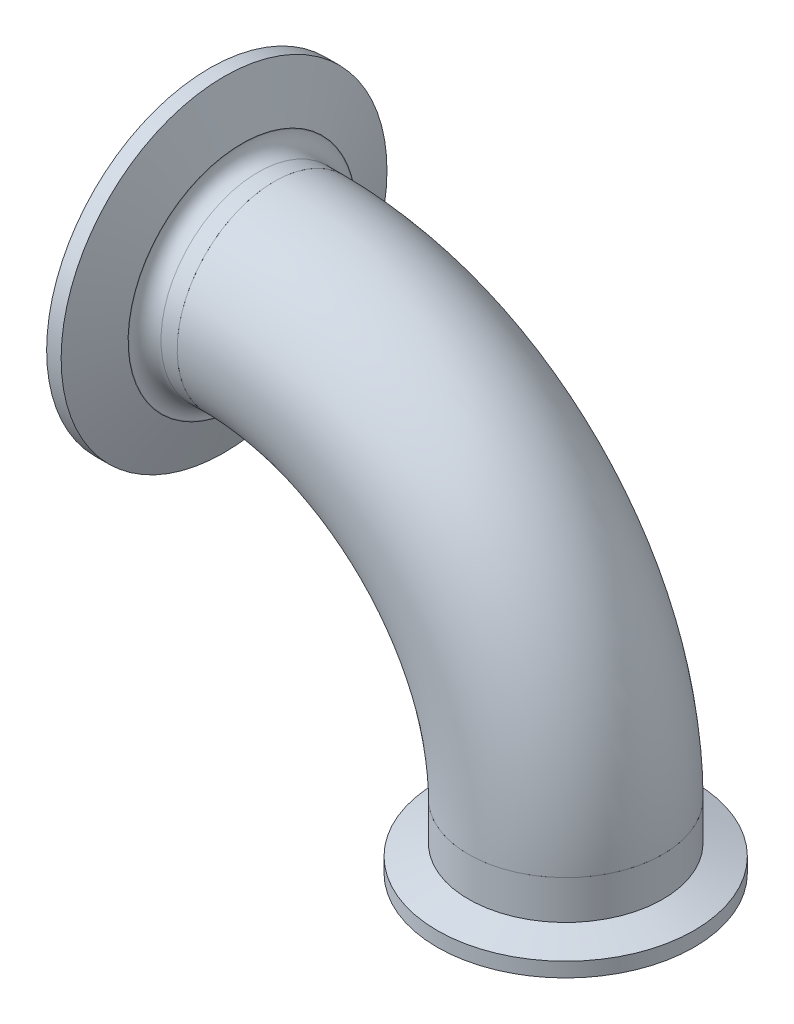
ISO-10303-21;
HEADER;
FILE_DESCRIPTION(('STEP AP214'),'2;1');
FILE_NAME('part.step','',(''),(''),'','','');
FILE_SCHEMA(('AUTOMOTIVE_DESIGN { 1 0 10303 214 1 1 1 1 }'));
ENDSEC;
DATA;
#1=APPLICATION_CONTEXT('core data for automotive mechanical design processes');
#2=APPLICATION_PROTOCOL_DEFINITION('international standard','automotive_design',2000,#1);
#3=PRODUCT_CONTEXT('',#1,'mechanical');
#4=PRODUCT('Part','Part','',(#3));
#5=PRODUCT_RELATED_PRODUCT_CATEGORY('part','',(#4));
#6=PRODUCT_DEFINITION_FORMATION('','',#4);
#7=PRODUCT_DEFINITION_CONTEXT('part definition',#1,'design');
#8=PRODUCT_DEFINITION('design','',#6,#7);
#9=PRODUCT_DEFINITION_SHAPE('','',#8);
#10=(LENGTH_UNIT() NAMED_UNIT(*) SI_UNIT(.MILLI.,.METRE.));
#11=(NAMED_UNIT(*) PLANE_ANGLE_UNIT() SI_UNIT($,.RADIAN.));
#12=(NAMED_UNIT(*) SI_UNIT($,.STERADIAN.) SOLID_ANGLE_UNIT());
#13=UNCERTAINTY_MEASURE_WITH_UNIT(LENGTH_MEASURE(1.E-05),#10,'distance_accuracy_value','');
#14=(GEOMETRIC_REPRESENTATION_CONTEXT(3) GLOBAL_UNCERTAINTY_ASSIGNED_CONTEXT((#13)) GLOBAL_UNIT_ASSIGNED_CONTEXT((#10,
#11,#12)) REPRESENTATION_CONTEXT('',''));
#15=CARTESIAN_POINT('',(0.,0.,0.));
#16=DIRECTION('',(0.,0.,1.));
#17=DIRECTION('',(1.,0.,0.));
#18=AXIS2_PLACEMENT_3D('',#15,#16,#17);
#19=CARTESIAN_POINT('',(70.807143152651,10.0297543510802,78.5347669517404));
#20=DIRECTION('',(0.,1.00000000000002,0.));
#21=DIRECTION('',(0.,0.,1.00000000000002));
#22=AXIS2_PLACEMENT_3D('',#19,#20,#21);
#23=CONICAL_SURFACE('',#22,20.9336326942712,0.401425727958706);
#24=CARTESIAN_POINT('',(70.8071431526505,9.51001827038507,78.5347669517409));
#25=DIRECTION('',(0.,-1.00000000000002,0.));
#26=DIRECTION('',(0.,0.,-1.00000000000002));
#27=AXIS2_PLACEMENT_3D('',#24,#25,#26);
#28=CIRCLE('',#27,20.7130178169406);
#29=CARTESIAN_POINT('',(70.8071431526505,9.51001827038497,57.8217491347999));
#30=VERTEX_POINT('',#29);
#31=EDGE_CURVE('P0_E10',#30,#30,#28,.T.);
#32=ORIENTED_EDGE('',*,*,#31,.F.);
#33=EDGE_LOOP('',(#32));
#34=FACE_BOUND('',#33,.T.);
#35=CARTESIAN_POINT('',(70.807143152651,10.0297543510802,78.5347669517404));
#36=DIRECTION('',(0.,-1.00000000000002,0.));
#37=DIRECTION('',(0.,0.,-1.00000000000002));
#38=AXIS2_PLACEMENT_3D('',#35,#36,#37);
#39=CIRCLE('',#38,20.9336326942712);
#40=CARTESIAN_POINT('',(70.807143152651,10.0297543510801,57.6011342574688));
#41=VERTEX_POINT('',#40);
#42=EDGE_CURVE('P0_E55',#41,#41,#39,.T.);
#43=ORIENTED_EDGE('',*,*,#42,.T.);
#44=EDGE_LOOP('',(#43));
#45=FACE_BOUND('',#44,.T.);
#46=ADVANCED_FACE('P0_F15',(#34,#45),#23,.T.);
#47=CARTESIAN_POINT('',(70.8071431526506,9.80775539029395,78.5347669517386));
#48=DIRECTION('',(0.,-1.00000000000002,0.));
#49=DIRECTION('',(0.,0.,-1.00000000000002));
#50=AXIS2_PLACEMENT_3D('',#47,#48,#49);
#51=TOROIDAL_SURFACE('',#50,20.0115931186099,0.761999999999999);
#52=CARTESIAN_POINT('',(70.8071431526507,9.04575539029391,78.5347669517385));
#53=DIRECTION('',(0.,-1.00000000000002,0.));
#54=DIRECTION('',(0.,0.,-1.00000000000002));
#55=AXIS2_PLACEMENT_3D('',#52,#53,#54);
#56=CIRCLE('',#55,20.0115931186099);
#57=CARTESIAN_POINT('',(70.8071431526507,9.04575539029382,58.5231738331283));
#58=VERTEX_POINT('',#57);
#59=EDGE_CURVE('P0_E21',#58,#58,#56,.T.);
#60=ORIENTED_EDGE('',*,*,#59,.F.);
#61=EDGE_LOOP('',(#60));
#62=FACE_BOUND('',#61,.T.);
#63=ORIENTED_EDGE('',*,*,#31,.T.);
#64=EDGE_LOOP('',(#63));
#65=FACE_BOUND('',#64,.T.);
#66=ADVANCED_FACE('P0_F85',(#62,#65),#51,.T.);
#67=CARTESIAN_POINT('',(70.8071431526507,9.04575539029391,78.5347669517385));
#68=DIRECTION('',(0.,1.00000000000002,0.));
#69=DIRECTION('',(0.,0.,1.00000000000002));
#70=AXIS2_PLACEMENT_3D('',#67,#68,#69);
#71=PLANE('',#70);
#72=CARTESIAN_POINT('',(70.8071431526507,9.04575539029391,78.5347669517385));
#73=DIRECTION('',(0.,-1.00000000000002,0.));
#74=DIRECTION('',(0.,0.,-1.00000000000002));
#75=AXIS2_PLACEMENT_3D('',#72,#73,#74);
#76=CIRCLE('',#75,17.399);
#77=CARTESIAN_POINT('',(70.8071431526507,9.04575539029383,61.1357669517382));
#78=VERTEX_POINT('',#77);
#79=EDGE_CURVE('P0_E25',#78,#78,#76,.T.);
#80=ORIENTED_EDGE('',*,*,#79,.F.);
#81=EDGE_LOOP('',(#80));
#82=FACE_BOUND('',#81,.T.);
#83=ORIENTED_EDGE('',*,*,#59,.T.);
#84=EDGE_LOOP('',(#83));
#85=FACE_BOUND('',#84,.T.);
#86=ADVANCED_FACE('P0_F90',(#82,#85),#71,.F.);
#87=CARTESIAN_POINT('',(70.8071431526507,9.04575539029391,78.5347669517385));
#88=DIRECTION('',(0.,-1.00000000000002,0.));
#89=DIRECTION('',(0.,0.,-1.00000000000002));
#90=AXIS2_PLACEMENT_3D('',#87,#88,#89);
#91=CYLINDRICAL_SURFACE('',#90,17.399);
#92=ORIENTED_EDGE('',*,*,#79,.T.);
#93=EDGE_LOOP('',(#92));
#94=FACE_BOUND('',#93,.T.);
#95=CARTESIAN_POINT('',(70.80714315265,21.7457553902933,78.5347669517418));
#96=DIRECTION('',(0.,-1.00000000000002,0.));
#97=DIRECTION('',(0.,0.,-1.00000000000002));
#98=AXIS2_PLACEMENT_3D('',#95,#96,#97);
#99=CIRCLE('',#98,17.399);
#100=CARTESIAN_POINT('',(70.80714315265,21.7457553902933,61.1357669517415));
#101=VERTEX_POINT('',#100);
#102=EDGE_CURVE('P0_E29',#101,#101,#99,.T.);
#103=ORIENTED_EDGE('',*,*,#102,.F.);
#104=EDGE_LOOP('',(#103));
#105=FACE_BOUND('',#104,.T.);
#106=ADVANCED_FACE('P0_F95',(#94,#105),#91,.F.);
#107=CARTESIAN_POINT('',(70.80714315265,21.7457553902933,78.5347669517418));
#108=DIRECTION('',(0.,-1.00000000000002,0.));
#109=DIRECTION('',(0.,0.,-1.00000000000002));
#110=AXIS2_PLACEMENT_3D('',#107,#108,#109);
#111=PLANE('',#110);
#112=CARTESIAN_POINT('',(70.80714315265,21.7457553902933,78.5347669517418));
#113=DIRECTION('',(0.,-1.00000000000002,0.));
#114=DIRECTION('',(0.,0.,-1.00000000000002));
#115=AXIS2_PLACEMENT_3D('',#112,#113,#114);
#116=CIRCLE('',#115,19.05);
#117=CARTESIAN_POINT('',(70.80714315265,21.7457553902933,59.4847669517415));
#118=VERTEX_POINT('',#117);
#119=EDGE_CURVE('P0_E34',#118,#118,#116,.T.);
#120=ORIENTED_EDGE('',*,*,#119,.F.);
#121=EDGE_LOOP('',(#120));
#122=FACE_BOUND('',#121,.T.);
#123=ORIENTED_EDGE('',*,*,#102,.T.);
#124=EDGE_LOOP('',(#123));
#125=FACE_BOUND('',#124,.T.);
#126=ADVANCED_FACE('P0_F101',(#122,#125),#111,.F.);
#127=CARTESIAN_POINT('',(70.8071431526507,9.04575539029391,78.5347669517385));
#128=DIRECTION('',(0.,-1.00000000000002,0.));
#129=DIRECTION('',(0.,0.,-1.00000000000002));
#130=AXIS2_PLACEMENT_3D('',#127,#128,#129);
#131=CYLINDRICAL_SURFACE('',#130,19.05);
#132=CARTESIAN_POINT('',(70.8071431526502,14.1278076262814,78.53476695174));
#133=DIRECTION('',(0.,-1.00000000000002,0.));
#134=DIRECTION('',(0.,0.,-1.00000000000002));
#135=AXIS2_PLACEMENT_3D('',#132,#133,#134);
#136=CIRCLE('',#135,19.05);
#137=CARTESIAN_POINT('',(70.8071431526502,14.1278076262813,59.4847669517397));
#138=VERTEX_POINT('',#137);
#139=EDGE_CURVE('P0_E37',#138,#138,#136,.T.);
#140=ORIENTED_EDGE('',*,*,#139,.F.);
#141=EDGE_LOOP('',(#140));
#142=FACE_BOUND('',#141,.T.);
#143=ORIENTED_EDGE('',*,*,#119,.T.);
#144=EDGE_LOOP('',(#143));
#145=FACE_BOUND('',#144,.T.);
#146=ADVANCED_FACE('P0_F105',(#142,#145),#131,.T.);
#147=CARTESIAN_POINT('',(70.8071431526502,14.1278076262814,78.53476695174));
#148=DIRECTION('',(0.,-1.00000000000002,0.));
#149=DIRECTION('',(0.,0.,-1.00000000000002));
#150=AXIS2_PLACEMENT_3D('',#147,#148,#149);
#151=CONICAL_SURFACE('',#150,19.05,1.22173047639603);
#152=CARTESIAN_POINT('',(70.8071431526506,11.8905553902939,78.5347669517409));
#153=DIRECTION('',(0.,-1.00000000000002,0.));
#154=DIRECTION('',(0.,0.,-1.00000000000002));
#155=AXIS2_PLACEMENT_3D('',#152,#153,#154);
#156=CIRCLE('',#155,25.1968);
#157=CARTESIAN_POINT('',(70.8071431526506,11.8905553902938,53.3379669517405));
#158=VERTEX_POINT('',#157);
#159=EDGE_CURVE('P0_E40',#158,#158,#156,.T.);
#160=ORIENTED_EDGE('',*,*,#159,.F.);
#161=EDGE_LOOP('',(#160));
#162=FACE_BOUND('',#161,.T.);
#163=ORIENTED_EDGE('',*,*,#139,.T.);
#164=EDGE_LOOP('',(#163));
#165=FACE_BOUND('',#164,.T.);
#166=ADVANCED_FACE('P0_F109',(#162,#165),#151,.T.);
#167=CARTESIAN_POINT('',(70.8071431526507,9.04575539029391,78.5347669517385));
#168=DIRECTION('',(0.,-1.00000000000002,0.));
#169=DIRECTION('',(0.,0.,-1.00000000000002));
#170=AXIS2_PLACEMENT_3D('',#167,#168,#169);
#171=CYLINDRICAL_SURFACE('',#170,25.1968);
#172=CARTESIAN_POINT('',(70.8071431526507,9.04575539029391,78.5347669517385));
#173=DIRECTION('',(0.,-1.00000000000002,0.));
#174=DIRECTION('',(0.,0.,-1.00000000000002));
#175=AXIS2_PLACEMENT_3D('',#172,#173,#174);
#176=CIRCLE('',#175,25.1968);
#177=CARTESIAN_POINT('',(70.8071431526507,9.04575539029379,53.3379669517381));
#178=VERTEX_POINT('',#177);
#179=EDGE_CURVE('P0_E43',#178,#178,#176,.T.);
#180=ORIENTED_EDGE('',*,*,#179,.F.);
#181=EDGE_LOOP('',(#180));
#182=FACE_BOUND('',#181,.T.);
#183=ORIENTED_EDGE('',*,*,#159,.T.);
#184=EDGE_LOOP('',(#183));
#185=FACE_BOUND('',#184,.T.);
#186=ADVANCED_FACE('P0_F81',(#182,#185),#171,.T.);
#187=CARTESIAN_POINT('',(70.8071431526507,9.04575539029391,78.5347669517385));
#188=DIRECTION('',(0.,1.00000000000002,0.));
#189=DIRECTION('',(0.,0.,1.00000000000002));
#190=AXIS2_PLACEMENT_3D('',#187,#188,#189);
#191=PLANE('',#190);
#192=CARTESIAN_POINT('',(70.8071431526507,9.04575539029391,78.5347669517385));
#193=DIRECTION('',(0.,-1.00000000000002,0.));
#194=DIRECTION('',(0.,0.,-1.00000000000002));
#195=AXIS2_PLACEMENT_3D('',#192,#193,#194);
#196=CIRCLE('',#195,23.9521599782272);
#197=CARTESIAN_POINT('',(70.8071431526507,9.0457553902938,54.5826069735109));
#198=VERTEX_POINT('',#197);
#199=EDGE_CURVE('P0_E46',#198,#198,#196,.T.);
#200=ORIENTED_EDGE('',*,*,#199,.F.);
#201=EDGE_LOOP('',(#200));
#202=FACE_BOUND('',#201,.T.);
#203=ORIENTED_EDGE('',*,*,#179,.T.);
#204=EDGE_LOOP('',(#203));
#205=FACE_BOUND('',#204,.T.);
#206=ADVANCED_FACE('P0_F74',(#202,#205),#191,.F.);
#207=CARTESIAN_POINT('',(70.8071431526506,9.80775539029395,78.5347669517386));
#208=DIRECTION('',(0.,-1.00000000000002,0.));
#209=DIRECTION('',(0.,0.,-1.00000000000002));
#210=AXIS2_PLACEMENT_3D('',#207,#208,#209);
#211=TOROIDAL_SURFACE('',#210,23.9521599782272,0.761999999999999);
#212=ORIENTED_EDGE('',*,*,#199,.T.);
#213=EDGE_LOOP('',(#212));
#214=FACE_BOUND('',#213,.T.);
#215=CARTESIAN_POINT('',(70.8071431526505,9.51001827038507,78.5347669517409));
#216=DIRECTION('',(0.,-1.00000000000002,0.));
#217=DIRECTION('',(0.,0.,-1.00000000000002));
#218=AXIS2_PLACEMENT_3D('',#215,#216,#217);
#219=CIRCLE('',#218,23.2507352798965);
#220=CARTESIAN_POINT('',(70.8071431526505,9.51001827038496,55.2840316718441));
#221=VERTEX_POINT('',#220);
#222=EDGE_CURVE('P0_E49',#221,#221,#219,.T.);
#223=ORIENTED_EDGE('',*,*,#222,.F.);
#224=EDGE_LOOP('',(#223));
#225=FACE_BOUND('',#224,.T.);
#226=ADVANCED_FACE('P0_F69',(#214,#225),#211,.T.);
#227=CARTESIAN_POINT('',(70.8071431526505,9.51001827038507,78.5347669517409));
#228=DIRECTION('',(0.,-1.00000000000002,0.));
#229=DIRECTION('',(0.,0.,-1.00000000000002));
#230=AXIS2_PLACEMENT_3D('',#227,#228,#229);
#231=CONICAL_SURFACE('',#230,23.2507352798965,0.401425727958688);
#232=CARTESIAN_POINT('',(70.8071431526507,9.91861021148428,78.5347669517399));
#233=DIRECTION('',(0.,-1.00000000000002,0.));
#234=DIRECTION('',(0.,0.,-1.00000000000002));
#235=AXIS2_PLACEMENT_3D('',#232,#233,#234);
#236=CIRCLE('',#235,23.0772982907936);
#237=CARTESIAN_POINT('',(70.8071431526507,9.91861021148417,55.4574686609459));
#238=VERTEX_POINT('',#237);
#239=EDGE_CURVE('P0_E52',#238,#238,#236,.T.);
#240=ORIENTED_EDGE('',*,*,#239,.F.);
#241=EDGE_LOOP('',(#240));
#242=FACE_BOUND('',#241,.T.);
#243=ORIENTED_EDGE('',*,*,#222,.T.);
#244=EDGE_LOOP('',(#243));
#245=FACE_BOUND('',#244,.T.);
#246=ADVANCED_FACE('P0_F63',(#242,#245),#231,.F.);
#247=CARTESIAN_POINT('',(70.8071431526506,9.45215539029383,78.5347669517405));
#248=DIRECTION('',(0.,-1.00000000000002,0.));
#249=DIRECTION('',(0.,0.,-1.00000000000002));
#250=AXIS2_PLACEMENT_3D('',#247,#248,#249);
#251=TOROIDAL_SURFACE('',#250,21.9783995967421,1.1938);
#252=ORIENTED_EDGE('',*,*,#42,.F.);
#253=EDGE_LOOP('',(#252));
#254=FACE_BOUND('',#253,.T.);
#255=ORIENTED_EDGE('',*,*,#239,.T.);
#256=EDGE_LOOP('',(#255));
#257=FACE_BOUND('',#256,.T.);
#258=ADVANCED_FACE('P0_F60',(#254,#257),#251,.F.);
#259=CLOSED_SHELL('',(#46,#66,#86,#106,#126,#146,#166,#186,#206,#226,#246,#258));
#260=MANIFOLD_SOLID_BREP('P0_B1',#259);
#261=CARTESIAN_POINT('',(13.65714315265,21.7457553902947,78.5347669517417));
#262=DIRECTION('',(0.,0.,-1.));
#263=DIRECTION('',(-1.,0.,0.));
#264=AXIS2_PLACEMENT_3D('',#261,#262,#263);
#265=TOROIDAL_SURFACE('',#264,57.15,19.05);
#266=CARTESIAN_POINT('',(13.6571431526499,78.8957553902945,78.5347669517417));
#267=DIRECTION('',(-1.,0.,0.));
#268=DIRECTION('',(0.,0.,1.));
#269=AXIS2_PLACEMENT_3D('',#266,#267,#268);
#270=CIRCLE('',#269,19.05);
#271=CARTESIAN_POINT('',(13.6571431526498,97.9457553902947,78.5347669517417));
#272=VERTEX_POINT('',#271);
#273=EDGE_CURVE('P1_E10',#272,#272,#270,.T.);
#274=CARTESIAN_POINT('',(70.80714315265,21.7457553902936,78.5347669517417));
#275=DIRECTION('',(0.,1.,0.));
#276=DIRECTION('',(0.,0.,1.));
#277=AXIS2_PLACEMENT_3D('',#274,#275,#276);
#278=CIRCLE('',#277,19.05);
#279=CARTESIAN_POINT('',(89.85714315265,21.7457553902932,78.5347669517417));
#280=VERTEX_POINT('',#279);
#281=EDGE_CURVE('P1_E21',#280,#280,#278,.T.);
#282=CARTESIAN_POINT('',(13.65714315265,21.7457553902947,78.5347669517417));
#283=DIRECTION('',(0.,0.,-1.));
#284=DIRECTION('',(-1.,0.,0.));
#285=AXIS2_PLACEMENT_3D('',#282,#283,#284);
#286=CIRCLE('',#285,76.2);
#287=EDGE_CURVE('',#272,#280,#286,.T.);
#288=ORIENTED_EDGE('',*,*,#273,.F.);
#289=ORIENTED_EDGE('',*,*,#281,.T.);
#290=ORIENTED_EDGE('',*,*,#287,.T.);
#291=ORIENTED_EDGE('',*,*,#287,.F.);
#292=EDGE_LOOP('',(#288,#290,#289,#291));
#293=FACE_BOUND('',#292,.T.);
#294=ADVANCED_FACE('P1_F15',(#293),#265,.T.);
#295=CARTESIAN_POINT('',(13.6571431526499,78.8957553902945,78.5347669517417));
#296=DIRECTION('',(-1.,0.,0.));
#297=DIRECTION('',(0.,0.,1.));
#298=AXIS2_PLACEMENT_3D('',#295,#296,#297);
#299=PLANE('',#298);
#300=CARTESIAN_POINT('',(13.6571431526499,78.8957553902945,78.5347669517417));
#301=DIRECTION('',(-1.,0.,0.));
#302=DIRECTION('',(0.,-1.,0.));
#303=AXIS2_PLACEMENT_3D('',#300,#301,#302);
#304=CIRCLE('',#303,17.399);
#305=CARTESIAN_POINT('',(13.6571431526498,96.2947553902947,78.5347669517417));
#306=VERTEX_POINT('',#305);
#307=EDGE_CURVE('P1_E25',#306,#306,#304,.T.);
#308=ORIENTED_EDGE('',*,*,#307,.F.);
#309=EDGE_LOOP('',(#308));
#310=FACE_BOUND('',#309,.T.);
#311=ORIENTED_EDGE('',*,*,#273,.T.);
#312=EDGE_LOOP('',(#311));
#313=FACE_BOUND('',#312,.T.);
#314=ADVANCED_FACE('P1_F46',(#310,#313),#299,.T.);
#315=CARTESIAN_POINT('',(70.80714315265,21.7457553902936,78.5347669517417));
#316=DIRECTION('',(0.,1.,0.));
#317=DIRECTION('',(0.,0.,1.));
#318=AXIS2_PLACEMENT_3D('',#315,#316,#317);
#319=PLANE('',#318);
#320=CARTESIAN_POINT('',(70.80714315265,21.7457553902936,78.5347669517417));
#321=DIRECTION('',(0.,1.,0.));
#322=DIRECTION('',(0.,0.,1.));
#323=AXIS2_PLACEMENT_3D('',#320,#321,#322);
#324=CIRCLE('',#323,17.399);
#325=CARTESIAN_POINT('',(88.20614315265,21.7457553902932,78.5347669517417));
#326=VERTEX_POINT('',#325);
#327=EDGE_CURVE('P1_E29',#326,#326,#324,.T.);
#328=ORIENTED_EDGE('',*,*,#327,.T.);
#329=EDGE_LOOP('',(#328));
#330=FACE_BOUND('',#329,.T.);
#331=ORIENTED_EDGE('',*,*,#281,.F.);
#332=EDGE_LOOP('',(#331));
#333=FACE_BOUND('',#332,.T.);
#334=ADVANCED_FACE('P1_F35',(#330,#333),#319,.F.);
#335=CARTESIAN_POINT('',(13.65714315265,21.7457553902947,78.5347669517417));
#336=DIRECTION('',(0.,0.,-1.));
#337=DIRECTION('',(-1.,0.,0.));
#338=AXIS2_PLACEMENT_3D('',#335,#336,#337);
#339=TOROIDAL_SURFACE('',#338,57.15,17.399);
#340=CARTESIAN_POINT('',(13.65714315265,21.7457553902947,78.5347669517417));
#341=DIRECTION('',(0.,0.,-1.));
#342=DIRECTION('',(-1.,0.,0.));
#343=AXIS2_PLACEMENT_3D('',#340,#341,#342);
#344=CIRCLE('',#343,74.549);
#345=EDGE_CURVE('',#306,#326,#344,.T.);
#346=ORIENTED_EDGE('',*,*,#307,.T.);
#347=ORIENTED_EDGE('',*,*,#327,.F.);
#348=ORIENTED_EDGE('',*,*,#345,.T.);
#349=ORIENTED_EDGE('',*,*,#345,.F.);
#350=EDGE_LOOP('',(#346,#348,#347,#349));
#351=FACE_BOUND('',#350,.T.);
#352=ADVANCED_FACE('P1_F38',(#351),#339,.F.);
#353=CLOSED_SHELL('',(#294,#314,#334,#352));
#354=MANIFOLD_SOLID_BREP('P1_B1',#353);
#355=CARTESIAN_POINT('',(13.6571431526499,92.270364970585,89.6633346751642));
#356=DIRECTION('',(-0.999999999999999,0.,0.));
#357=DIRECTION('',(0.,0.639609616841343,-0.768699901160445));
#358=AXIS2_PLACEMENT_3D('',#355,#356,#357);
#359=PLANE('',#358);
#360=CARTESIAN_POINT('',(13.6571431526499,78.8957553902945,78.5347669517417));
#361=DIRECTION('',(-0.999999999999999,0.,0.));
#362=DIRECTION('',(0.,0.639609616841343,-0.768699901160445));
#363=AXIS2_PLACEMENT_3D('',#360,#361,#362);
#364=CIRCLE('',#363,19.05);
#365=CARTESIAN_POINT('',(13.6571431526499,91.0803185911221,63.8910338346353));
#366=VERTEX_POINT('',#365);
#367=EDGE_CURVE('P2_E9',#366,#366,#364,.T.);
#368=ORIENTED_EDGE('',*,*,#367,.F.);
#369=EDGE_LOOP('',(#368));
#370=FACE_BOUND('',#369,.T.);
#371=CARTESIAN_POINT('',(13.6571431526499,78.8957553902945,78.5347669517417));
#372=DIRECTION('',(-0.999999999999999,0.,0.));
#373=DIRECTION('',(0.,0.639609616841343,-0.768699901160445));
#374=AXIS2_PLACEMENT_3D('',#371,#372,#373);
#375=CIRCLE('',#374,17.399);
#376=CARTESIAN_POINT('',(13.6571431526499,90.024323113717,65.1601573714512));
#377=VERTEX_POINT('',#376);
#378=EDGE_CURVE('P2_E63',#377,#377,#375,.T.);
#379=ORIENTED_EDGE('',*,*,#378,.T.);
#380=EDGE_LOOP('',(#379));
#381=FACE_BOUND('',#380,.T.);
#382=ADVANCED_FACE('P2_F14',(#370,#381),#359,.F.);
#383=CARTESIAN_POINT('',(0.9571431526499,78.8957553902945,78.5347669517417));
#384=DIRECTION('',(-0.999999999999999,0.,0.));
#385=DIRECTION('',(0.,0.639609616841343,-0.768699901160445));
#386=AXIS2_PLACEMENT_3D('',#383,#384,#385);
#387=CYLINDRICAL_SURFACE('',#386,19.05);
#388=CARTESIAN_POINT('',(10.4821431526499,78.8957553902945,78.5347669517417));
#389=DIRECTION('',(-0.999999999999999,0.,0.));
#390=DIRECTION('',(0.,0.639609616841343,-0.768699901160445));
#391=AXIS2_PLACEMENT_3D('',#388,#389,#390);
#392=CIRCLE('',#391,19.05);
#393=CARTESIAN_POINT('',(10.4821431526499,91.0803185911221,63.8910338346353));
#394=VERTEX_POINT('',#393);
#395=EDGE_CURVE('P2_E20',#394,#394,#392,.T.);
#396=CARTESIAN_POINT('',(10.4821431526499,91.0803185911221,63.8910338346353));
#397=CARTESIAN_POINT('',(10.5152160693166,91.0803185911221,63.8910338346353));
#398=CARTESIAN_POINT('',(10.5482889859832,91.0803185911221,63.8910338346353));
#399=CARTESIAN_POINT('',(10.6144348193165,91.0803185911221,63.8910338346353));
#400=CARTESIAN_POINT('',(10.6475077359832,91.0803185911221,63.8910338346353));
#401=CARTESIAN_POINT('',(10.7136535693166,91.0803185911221,63.8910338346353));
#402=CARTESIAN_POINT('',(10.7467264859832,91.0803185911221,63.8910338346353));
#403=CARTESIAN_POINT('',(10.8128723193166,91.0803185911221,63.8910338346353));
#404=CARTESIAN_POINT('',(10.8459452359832,91.0803185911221,63.8910338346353));
#405=CARTESIAN_POINT('',(10.9120910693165,91.0803185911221,63.8910338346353));
#406=CARTESIAN_POINT('',(10.9451639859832,91.0803185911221,63.8910338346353));
#407=CARTESIAN_POINT('',(11.0113098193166,91.0803185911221,63.8910338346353));
#408=CARTESIAN_POINT('',(11.0443827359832,91.0803185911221,63.8910338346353));
#409=CARTESIAN_POINT('',(11.1105285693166,91.0803185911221,63.8910338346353));
#410=CARTESIAN_POINT('',(11.1436014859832,91.0803185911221,63.8910338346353));
#411=CARTESIAN_POINT('',(11.2097473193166,91.0803185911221,63.8910338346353));
#412=CARTESIAN_POINT('',(11.2428202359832,91.0803185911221,63.8910338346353));
#413=CARTESIAN_POINT('',(11.3089660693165,91.0803185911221,63.8910338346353));
#414=CARTESIAN_POINT('',(11.3420389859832,91.0803185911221,63.8910338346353));
#415=CARTESIAN_POINT('',(11.4081848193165,91.0803185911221,63.8910338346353));
#416=CARTESIAN_POINT('',(11.4412577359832,91.0803185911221,63.8910338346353));
#417=CARTESIAN_POINT('',(11.5074035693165,91.0803185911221,63.8910338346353));
#418=CARTESIAN_POINT('',(11.5404764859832,91.0803185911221,63.8910338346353));
#419=CARTESIAN_POINT('',(11.6066223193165,91.0803185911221,63.8910338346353));
#420=CARTESIAN_POINT('',(11.6396952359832,91.0803185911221,63.8910338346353));
#421=CARTESIAN_POINT('',(11.7058410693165,91.0803185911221,63.8910338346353));
#422=CARTESIAN_POINT('',(11.7389139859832,91.0803185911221,63.8910338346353));
#423=CARTESIAN_POINT('',(11.8050598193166,91.0803185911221,63.8910338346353));
#424=CARTESIAN_POINT('',(11.8381327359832,91.0803185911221,63.8910338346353));
#425=CARTESIAN_POINT('',(11.9042785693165,91.0803185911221,63.8910338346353));
#426=CARTESIAN_POINT('',(11.9373514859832,91.0803185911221,63.8910338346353));
#427=CARTESIAN_POINT('',(12.0034973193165,91.0803185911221,63.8910338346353));
#428=CARTESIAN_POINT('',(12.0365702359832,91.0803185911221,63.8910338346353));
#429=CARTESIAN_POINT('',(12.1027160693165,91.0803185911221,63.8910338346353));
#430=CARTESIAN_POINT('',(12.1357889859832,91.0803185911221,63.8910338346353));
#431=CARTESIAN_POINT('',(12.2019348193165,91.0803185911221,63.8910338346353));
#432=CARTESIAN_POINT('',(12.2350077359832,91.0803185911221,63.8910338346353));
#433=CARTESIAN_POINT('',(12.3011535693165,91.0803185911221,63.8910338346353));
#434=CARTESIAN_POINT('',(12.3342264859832,91.0803185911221,63.8910338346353));
#435=CARTESIAN_POINT('',(12.4003723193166,91.0803185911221,63.8910338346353));
#436=CARTESIAN_POINT('',(12.4334452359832,91.0803185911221,63.8910338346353));
#437=CARTESIAN_POINT('',(12.4995910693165,91.0803185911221,63.8910338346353));
#438=CARTESIAN_POINT('',(12.5326639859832,91.0803185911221,63.8910338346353));
#439=CARTESIAN_POINT('',(12.5988098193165,91.0803185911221,63.8910338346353));
#440=CARTESIAN_POINT('',(12.6318827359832,91.0803185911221,63.8910338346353));
#441=CARTESIAN_POINT('',(12.6980285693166,91.0803185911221,63.8910338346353));
#442=CARTESIAN_POINT('',(12.7311014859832,91.0803185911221,63.8910338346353));
#443=CARTESIAN_POINT('',(12.7972473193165,91.0803185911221,63.8910338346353));
#444=CARTESIAN_POINT('',(12.8303202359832,91.0803185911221,63.8910338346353));
#445=CARTESIAN_POINT('',(12.8964660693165,91.0803185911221,63.8910338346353));
#446=CARTESIAN_POINT('',(12.9295389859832,91.0803185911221,63.8910338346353));
#447=CARTESIAN_POINT('',(12.9956848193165,91.0803185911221,63.8910338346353));
#448=CARTESIAN_POINT('',(13.0287577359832,91.0803185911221,63.8910338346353));
#449=CARTESIAN_POINT('',(13.0949035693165,91.0803185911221,63.8910338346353));
#450=CARTESIAN_POINT('',(13.1279764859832,91.0803185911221,63.8910338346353));
#451=CARTESIAN_POINT('',(13.1941223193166,91.0803185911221,63.8910338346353));
#452=CARTESIAN_POINT('',(13.2271952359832,91.0803185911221,63.8910338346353));
#453=CARTESIAN_POINT('',(13.2933410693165,91.0803185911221,63.8910338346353));
#454=CARTESIAN_POINT('',(13.3264139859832,91.0803185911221,63.8910338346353));
#455=CARTESIAN_POINT('',(13.3925598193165,91.0803185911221,63.8910338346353));
#456=CARTESIAN_POINT('',(13.4256327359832,91.0803185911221,63.8910338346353));
#457=CARTESIAN_POINT('',(13.4917785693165,91.0803185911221,63.8910338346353));
#458=CARTESIAN_POINT('',(13.5248514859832,91.0803185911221,63.8910338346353));
#459=CARTESIAN_POINT('',(13.5909973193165,91.0803185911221,63.8910338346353));
#460=CARTESIAN_POINT('',(13.6240702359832,91.0803185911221,63.8910338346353));
#461=CARTESIAN_POINT('',(13.6571431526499,91.0803185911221,63.8910338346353));
#462=B_SPLINE_CURVE_WITH_KNOTS('',3,(#396,#397,#398,#399,#400,#401,#402,#403,#404,#405,#406,
#407,#408,#409,#410,#411,#412,#413,#414,#415,#416,#417,#418,#419,#420,#421,#422,#423,#424,#425,
#426,#427,#428,#429,#430,#431,#432,#433,#434,#435,#436,#437,#438,#439,#440,#441,#442,#443,#444,
#445,#446,#447,#448,#449,#450,#451,#452,#453,#454,#455,#456,#457,#458,#459,#460,#461),
.UNSPECIFIED.,.F.,.F.,(4,2,2,2,2,2,2,2,2,2,2,2,2,2,2,2,2,2,2,2,2,2,2,2,2,2,2,2,2,2,2,2,4),(0.,
0.0992187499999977,0.198437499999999,0.29765625,0.396874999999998,0.496093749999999,0.5953125,
0.694531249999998,0.793749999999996,0.892968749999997,0.992187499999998,1.09140625,1.190625,
1.28984375,1.3890625,1.48828125,1.5875,1.68671875,1.7859375,1.88515625,1.984375,2.08359375,
2.1828125,2.28203125,2.38125,2.48046875,2.5796875,2.67890625,2.778125,2.87734375,2.9765625,
3.07578125,3.175),.UNSPECIFIED.);
#463=EDGE_CURVE('P2_BSEAM142',#394,#366,#462,.T.);
#464=ORIENTED_EDGE('',*,*,#395,.F.);
#465=ORIENTED_EDGE('',*,*,#367,.T.);
#466=ORIENTED_EDGE('',*,*,#463,.T.);
#467=ORIENTED_EDGE('',*,*,#463,.F.);
#468=EDGE_LOOP('',(#464,#466,#465,#467));
#469=FACE_BOUND('',#468,.T.);
#470=ADVANCED_FACE('P2_F142',(#469),#387,.T.);
#471=CARTESIAN_POINT('',(10.4821431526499,78.8957553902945,78.5347669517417));
#472=DIRECTION('',(-0.999999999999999,0.,0.));
#473=DIRECTION('',(0.,0.639609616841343,-0.768699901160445));
#474=AXIS2_PLACEMENT_3D('',#471,#472,#473);
#475=TOROIDAL_SURFACE('',#474,22.225,3.175);
#476=CARTESIAN_POINT('',(7.30714315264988,78.8957553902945,78.5347669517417));
#477=DIRECTION('',(-0.999999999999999,0.,0.));
#478=DIRECTION('',(0.,0.639609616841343,-0.768699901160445));
#479=AXIS2_PLACEMENT_3D('',#476,#477,#478);
#480=CIRCLE('',#479,22.225);
#481=CARTESIAN_POINT('',(7.30714315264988,93.1110791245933,61.4504116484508));
#482=VERTEX_POINT('',#481);
#483=EDGE_CURVE('P2_E24',#482,#482,#480,.T.);
#484=ORIENTED_EDGE('',*,*,#483,.F.);
#485=EDGE_LOOP('',(#484));
#486=FACE_BOUND('',#485,.T.);
#487=ORIENTED_EDGE('',*,*,#395,.T.);
#488=EDGE_LOOP('',(#487));
#489=FACE_BOUND('',#488,.T.);
#490=ADVANCED_FACE('P2_F137',(#486,#489),#475,.F.);
#491=CARTESIAN_POINT('',(7.30714315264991,95.9801106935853,92.7500906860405));
#492=DIRECTION('',(-0.999999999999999,0.,0.));
#493=DIRECTION('',(0.,0.639609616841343,-0.768699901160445));
#494=AXIS2_PLACEMENT_3D('',#491,#492,#493);
#495=PLANE('',#494);
#496=CARTESIAN_POINT('',(7.30714315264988,78.8957553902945,78.5347669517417));
#497=DIRECTION('',(-0.999999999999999,0.,0.));
#498=DIRECTION('',(0.,0.639609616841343,-0.768699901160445));
#499=AXIS2_PLACEMENT_3D('',#496,#497,#498);
#500=CIRCLE('',#499,22.3227421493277);
#501=CARTESIAN_POINT('',(7.30714315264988,93.1735959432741,61.3752772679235));
#502=VERTEX_POINT('',#501);
#503=EDGE_CURVE('P2_E28',#502,#502,#500,.T.);
#504=ORIENTED_EDGE('',*,*,#503,.F.);
#505=EDGE_LOOP('',(#504));
#506=FACE_BOUND('',#505,.T.);
#507=ORIENTED_EDGE('',*,*,#483,.T.);
#508=EDGE_LOOP('',(#507));
#509=FACE_BOUND('',#508,.T.);
#510=ADVANCED_FACE('P2_F131',(#506,#509),#495,.F.);
#511=CARTESIAN_POINT('',(7.30714315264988,78.8957553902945,78.5347669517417));
#512=DIRECTION('',(-0.999999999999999,0.,0.));
#513=DIRECTION('',(0.,0.639609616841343,-0.768699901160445));
#514=AXIS2_PLACEMENT_3D('',#511,#512,#513);
#515=CONICAL_SURFACE('',#514,22.3227421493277,1.22173047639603);
#516=CARTESIAN_POINT('',(3.8019431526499,78.8957553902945,78.5347669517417));
#517=DIRECTION('',(-0.999999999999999,0.,0.));
#518=DIRECTION('',(0.,0.639609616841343,-0.768699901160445));
#519=AXIS2_PLACEMENT_3D('',#516,#517,#518);
#520=CIRCLE('',#519,31.9532);
#521=CARTESIAN_POINT('',(3.8019431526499,99.3333293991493,53.9723452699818));
#522=VERTEX_POINT('',#521);
#523=EDGE_CURVE('P2_E33',#522,#522,#520,.T.);
#524=CARTESIAN_POINT('',(3.8019431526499,99.3333293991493,53.9723452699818));
#525=CARTESIAN_POINT('',(3.8384556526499,99.2691655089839,54.0494591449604));
#526=CARTESIAN_POINT('',(3.8749681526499,99.2050016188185,54.126573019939));
#527=CARTESIAN_POINT('',(3.94799315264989,99.0766738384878,54.2808007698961));
#528=CARTESIAN_POINT('',(3.98450565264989,99.0125099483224,54.3579146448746));
#529=CARTESIAN_POINT('',(4.05753065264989,98.8841821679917,54.5121423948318));
#530=CARTESIAN_POINT('',(4.09404315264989,98.8200182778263,54.5892562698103));
#531=CARTESIAN_POINT('',(4.16706815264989,98.6916904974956,54.7434840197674));
#532=CARTESIAN_POINT('',(4.20358065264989,98.6275266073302,54.820597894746));
#533=CARTESIAN_POINT('',(4.27660565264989,98.4991988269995,54.9748256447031));
#534=CARTESIAN_POINT('',(4.31311815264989,98.4350349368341,55.0519395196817));
#535=CARTESIAN_POINT('',(4.38614315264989,98.3067071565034,55.2061672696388));
#536=CARTESIAN_POINT('',(4.42265565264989,98.242543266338,55.2832811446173));
#537=CARTESIAN_POINT('',(4.49568065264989,98.1142154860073,55.4375088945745));
#538=CARTESIAN_POINT('',(4.53219315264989,98.0500515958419,55.514622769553));
#539=CARTESIAN_POINT('',(4.60521815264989,97.9217238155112,55.6688505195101));
#540=CARTESIAN_POINT('',(4.64173065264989,97.8575599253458,55.7459643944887));
#541=CARTESIAN_POINT('',(4.71475565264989,97.7292321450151,55.9001921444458));
#542=CARTESIAN_POINT('',(4.75126815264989,97.6650682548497,55.9773060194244));
#543=CARTESIAN_POINT('',(4.82429315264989,97.536740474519,56.1315337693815));
#544=CARTESIAN_POINT('',(4.86080565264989,97.4725765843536,56.20864764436));
#545=CARTESIAN_POINT('',(4.93383065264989,97.3442488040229,56.3628753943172));
#546=CARTESIAN_POINT('',(4.97034315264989,97.2800849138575,56.4399892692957));
#547=CARTESIAN_POINT('',(5.04336815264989,97.1517571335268,56.5942170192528));
#548=CARTESIAN_POINT('',(5.07988065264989,97.0875932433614,56.6713308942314));
#549=CARTESIAN_POINT('',(5.15290565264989,96.9592654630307,56.8255586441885));
#550=CARTESIAN_POINT('',(5.18941815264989,96.8951015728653,56.9026725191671));
#551=CARTESIAN_POINT('',(5.26244315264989,96.7667737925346,57.0569002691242));
#552=CARTESIAN_POINT('',(5.29895565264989,96.7026099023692,57.1340141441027));
#553=CARTESIAN_POINT('',(5.37198065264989,96.5742821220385,57.2882418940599));
#554=CARTESIAN_POINT('',(5.40849315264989,96.5101182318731,57.3653557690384));
#555=CARTESIAN_POINT('',(5.48151815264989,96.3817904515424,57.5195835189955));
#556=CARTESIAN_POINT('',(5.51803065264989,96.317626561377,57.5966973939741));
#557=CARTESIAN_POINT('',(5.59105565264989,96.1892987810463,57.7509251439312));
#558=CARTESIAN_POINT('',(5.62756815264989,96.1251348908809,57.8280390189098));
#559=CARTESIAN_POINT('',(5.70059315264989,95.9968071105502,57.9822667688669));
#560=CARTESIAN_POINT('',(5.73710565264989,95.9326432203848,58.0593806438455));
#561=CARTESIAN_POINT('',(5.81013065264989,95.8043154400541,58.2136083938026));
#562=CARTESIAN_POINT('',(5.84664315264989,95.7401515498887,58.2907222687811));
#563=CARTESIAN_POINT('',(5.91966815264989,95.611823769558,58.4449500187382));
#564=CARTESIAN_POINT('',(5.95618065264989,95.5476598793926,58.5220638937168));
#565=CARTESIAN_POINT('',(6.02920565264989,95.4193320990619,58.6762916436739));
#566=CARTESIAN_POINT('',(6.06571815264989,95.3551682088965,58.7534055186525));
#567=CARTESIAN_POINT('',(6.13874315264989,95.2268404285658,58.9076332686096));
#568=CARTESIAN_POINT('',(6.17525565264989,95.1626765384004,58.9847471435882));
#569=CARTESIAN_POINT('',(6.24828065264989,95.0343487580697,59.1389748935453));
#570=CARTESIAN_POINT('',(6.28479315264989,94.9701848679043,59.2160887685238));
#571=CARTESIAN_POINT('',(6.35781815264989,94.8418570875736,59.3703165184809));
#572=CARTESIAN_POINT('',(6.39433065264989,94.7776931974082,59.4474303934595));
#573=CARTESIAN_POINT('',(6.46735565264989,94.6493654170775,59.6016581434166));
#574=CARTESIAN_POINT('',(6.50386815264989,94.5852015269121,59.6787720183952));
#575=CARTESIAN_POINT('',(6.57689315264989,94.4568737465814,59.8329997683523));
#576=CARTESIAN_POINT('',(6.61340565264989,94.392709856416,59.9101136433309));
#577=CARTESIAN_POINT('',(6.68643065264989,94.2643820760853,60.064341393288));
#578=CARTESIAN_POINT('',(6.72294315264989,94.2002181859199,60.1414552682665));
#579=CARTESIAN_POINT('',(6.79596815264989,94.0718904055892,60.2956830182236));
#580=CARTESIAN_POINT('',(6.83248065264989,94.0077265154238,60.3727968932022));
#581=CARTESIAN_POINT('',(6.90550565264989,93.8793987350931,60.5270246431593));
#582=CARTESIAN_POINT('',(6.94201815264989,93.8152348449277,60.6041385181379));
#583=CARTESIAN_POINT('',(7.01504315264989,93.686907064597,60.758366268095));
#584=CARTESIAN_POINT('',(7.05155565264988,93.6227431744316,60.8354801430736));
#585=CARTESIAN_POINT('',(7.12458065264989,93.4944153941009,60.9897078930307));
#586=CARTESIAN_POINT('',(7.16109315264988,93.4302515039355,61.0668217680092));
#587=CARTESIAN_POINT('',(7.23411815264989,93.3019237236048,61.2210495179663));
#588=CARTESIAN_POINT('',(7.27063065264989,93.2377598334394,61.2981633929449));
#589=CARTESIAN_POINT('',(7.30714315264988,93.1735959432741,61.3752772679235));
#590=B_SPLINE_CURVE_WITH_KNOTS('',3,(#524,#525,#526,#527,#528,#529,#530,#531,#532,#533,#534,
#535,#536,#537,#538,#539,#540,#541,#542,#543,#544,#545,#546,#547,#548,#549,#550,#551,#552,#553,
#554,#555,#556,#557,#558,#559,#560,#561,#562,#563,#564,#565,#566,#567,#568,#569,#570,#571,#572,
#573,#574,#575,#576,#577,#578,#579,#580,#581,#582,#583,#584,#585,#586,#587,#588,#589),
.UNSPECIFIED.,.F.,.F.,(4,2,2,2,2,2,2,2,2,2,2,2,2,2,2,2,2,2,2,2,2,2,2,2,2,2,2,2,2,2,2,2,4),(0.,
0.320266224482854,0.640532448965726,0.960798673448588,1.28106489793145,1.60133112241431,
1.92159734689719,2.24186357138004,2.5621297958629,2.88239602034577,3.20266224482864,
3.52292846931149,3.84319469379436,4.16346091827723,4.48372714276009,4.80399336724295,
5.12425959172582,5.44452581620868,5.76479204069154,6.0850582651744,6.40532448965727,
6.72559071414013,7.045856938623,7.36612316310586,7.68638938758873,8.00665561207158,
8.32692183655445,8.64718806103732,8.96745428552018,9.28772051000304,9.60798673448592,
9.92825295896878,10.2485191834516),.UNSPECIFIED.);
#591=EDGE_CURVE('P2_BSEAM125',#522,#502,#590,.T.);
#592=ORIENTED_EDGE('',*,*,#523,.F.);
#593=ORIENTED_EDGE('',*,*,#503,.T.);
#594=ORIENTED_EDGE('',*,*,#591,.T.);
#595=ORIENTED_EDGE('',*,*,#591,.F.);
#596=EDGE_LOOP('',(#592,#594,#593,#595));
#597=FACE_BOUND('',#596,.T.);
#598=ADVANCED_FACE('P2_F125',(#597),#515,.T.);
#599=CARTESIAN_POINT('',(0.9571431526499,78.8957553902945,78.5347669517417));
#600=DIRECTION('',(-0.999999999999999,0.,0.));
#601=DIRECTION('',(0.,0.639609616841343,-0.768699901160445));
#602=AXIS2_PLACEMENT_3D('',#599,#600,#601);
#603=CYLINDRICAL_SURFACE('',#602,31.9532);
#604=CARTESIAN_POINT('',(0.9571431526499,78.8957553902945,78.5347669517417));
#605=DIRECTION('',(-0.999999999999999,0.,0.));
#606=DIRECTION('',(0.,0.639609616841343,-0.768699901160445));
#607=AXIS2_PLACEMENT_3D('',#604,#605,#606);
#608=CIRCLE('',#607,31.9532);
#609=CARTESIAN_POINT('',(0.957143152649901,99.3333293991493,53.9723452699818));
#610=VERTEX_POINT('',#609);
#611=EDGE_CURVE('P2_E36',#610,#610,#608,.T.);
#612=CARTESIAN_POINT('',(0.957143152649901,99.3333293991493,53.9723452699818));
#613=CARTESIAN_POINT('',(0.986776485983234,99.3333293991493,53.9723452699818));
#614=CARTESIAN_POINT('',(1.01640981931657,99.3333293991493,53.9723452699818));
#615=CARTESIAN_POINT('',(1.07567648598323,99.3333293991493,53.9723452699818));
#616=CARTESIAN_POINT('',(1.10530981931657,99.3333293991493,53.9723452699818));
#617=CARTESIAN_POINT('',(1.16457648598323,99.3333293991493,53.9723452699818));
#618=CARTESIAN_POINT('',(1.19420981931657,99.3333293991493,53.9723452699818));
#619=CARTESIAN_POINT('',(1.25347648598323,99.3333293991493,53.9723452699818));
#620=CARTESIAN_POINT('',(1.28310981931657,99.3333293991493,53.9723452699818));
#621=CARTESIAN_POINT('',(1.34237648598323,99.3333293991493,53.9723452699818));
#622=CARTESIAN_POINT('',(1.37200981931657,99.3333293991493,53.9723452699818));
#623=CARTESIAN_POINT('',(1.43127648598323,99.3333293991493,53.9723452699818));
#624=CARTESIAN_POINT('',(1.46090981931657,99.3333293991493,53.9723452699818));
#625=CARTESIAN_POINT('',(1.52017648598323,99.3333293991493,53.9723452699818));
#626=CARTESIAN_POINT('',(1.54980981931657,99.3333293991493,53.9723452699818));
#627=CARTESIAN_POINT('',(1.60907648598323,99.3333293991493,53.9723452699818));
#628=CARTESIAN_POINT('',(1.63870981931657,99.3333293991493,53.9723452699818));
#629=CARTESIAN_POINT('',(1.69797648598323,99.3333293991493,53.9723452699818));
#630=CARTESIAN_POINT('',(1.72760981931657,99.3333293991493,53.9723452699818));
#631=CARTESIAN_POINT('',(1.78687648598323,99.3333293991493,53.9723452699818));
#632=CARTESIAN_POINT('',(1.81650981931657,99.3333293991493,53.9723452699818));
#633=CARTESIAN_POINT('',(1.87577648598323,99.3333293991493,53.9723452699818));
#634=CARTESIAN_POINT('',(1.90540981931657,99.3333293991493,53.9723452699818));
#635=CARTESIAN_POINT('',(1.96467648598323,99.3333293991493,53.9723452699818));
#636=CARTESIAN_POINT('',(1.99430981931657,99.3333293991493,53.9723452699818));
#637=CARTESIAN_POINT('',(2.05357648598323,99.3333293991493,53.9723452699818));
#638=CARTESIAN_POINT('',(2.08320981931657,99.3333293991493,53.9723452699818));
#639=CARTESIAN_POINT('',(2.14247648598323,99.3333293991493,53.9723452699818));
#640=CARTESIAN_POINT('',(2.17210981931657,99.3333293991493,53.9723452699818));
#641=CARTESIAN_POINT('',(2.23137648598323,99.3333293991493,53.9723452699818));
#642=CARTESIAN_POINT('',(2.26100981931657,99.3333293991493,53.9723452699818));
#643=CARTESIAN_POINT('',(2.32027648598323,99.3333293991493,53.9723452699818));
#644=CARTESIAN_POINT('',(2.34990981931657,99.3333293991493,53.9723452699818));
#645=CARTESIAN_POINT('',(2.40917648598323,99.3333293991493,53.9723452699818));
#646=CARTESIAN_POINT('',(2.43880981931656,99.3333293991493,53.9723452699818));
#647=CARTESIAN_POINT('',(2.49807648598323,99.3333293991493,53.9723452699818));
#648=CARTESIAN_POINT('',(2.52770981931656,99.3333293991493,53.9723452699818));
#649=CARTESIAN_POINT('',(2.58697648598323,99.3333293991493,53.9723452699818));
#650=CARTESIAN_POINT('',(2.61660981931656,99.3333293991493,53.9723452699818));
#651=CARTESIAN_POINT('',(2.67587648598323,99.3333293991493,53.9723452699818));
#652=CARTESIAN_POINT('',(2.70550981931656,99.3333293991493,53.9723452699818));
#653=CARTESIAN_POINT('',(2.76477648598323,99.3333293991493,53.9723452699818));
#654=CARTESIAN_POINT('',(2.79440981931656,99.3333293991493,53.9723452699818));
#655=CARTESIAN_POINT('',(2.85367648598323,99.3333293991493,53.9723452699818));
#656=CARTESIAN_POINT('',(2.88330981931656,99.3333293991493,53.9723452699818));
#657=CARTESIAN_POINT('',(2.94257648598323,99.3333293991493,53.9723452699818));
#658=CARTESIAN_POINT('',(2.97220981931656,99.3333293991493,53.9723452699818));
#659=CARTESIAN_POINT('',(3.03147648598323,99.3333293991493,53.9723452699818));
#660=CARTESIAN_POINT('',(3.06110981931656,99.3333293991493,53.9723452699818));
#661=CARTESIAN_POINT('',(3.12037648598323,99.3333293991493,53.9723452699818));
#662=CARTESIAN_POINT('',(3.15000981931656,99.3333293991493,53.9723452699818));
#663=CARTESIAN_POINT('',(3.20927648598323,99.3333293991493,53.9723452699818));
#664=CARTESIAN_POINT('',(3.23890981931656,99.3333293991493,53.9723452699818));
#665=CARTESIAN_POINT('',(3.29817648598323,99.3333293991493,53.9723452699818));
#666=CARTESIAN_POINT('',(3.32780981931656,99.3333293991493,53.9723452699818));
#667=CARTESIAN_POINT('',(3.38707648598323,99.3333293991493,53.9723452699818));
#668=CARTESIAN_POINT('',(3.41670981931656,99.3333293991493,53.9723452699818));
#669=CARTESIAN_POINT('',(3.47597648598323,99.3333293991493,53.9723452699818));
#670=CARTESIAN_POINT('',(3.50560981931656,99.3333293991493,53.9723452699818));
#671=CARTESIAN_POINT('',(3.56487648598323,99.3333293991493,53.9723452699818));
#672=CARTESIAN_POINT('',(3.59450981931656,99.3333293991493,53.9723452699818));
#673=CARTESIAN_POINT('',(3.65377648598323,99.3333293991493,53.9723452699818));
#674=CARTESIAN_POINT('',(3.68340981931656,99.3333293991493,53.9723452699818));
#675=CARTESIAN_POINT('',(3.74267648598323,99.3333293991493,53.9723452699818));
#676=CARTESIAN_POINT('',(3.77230981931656,99.3333293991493,53.9723452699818));
#677=CARTESIAN_POINT('',(3.8019431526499,99.3333293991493,53.9723452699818));
#678=B_SPLINE_CURVE_WITH_KNOTS('',3,(#612,#613,#614,#615,#616,#617,#618,#619,#620,#621,#622,
#623,#624,#625,#626,#627,#628,#629,#630,#631,#632,#633,#634,#635,#636,#637,#638,#639,#640,#641,
#642,#643,#644,#645,#646,#647,#648,#649,#650,#651,#652,#653,#654,#655,#656,#657,#658,#659,#660,
#661,#662,#663,#664,#665,#666,#667,#668,#669,#670,#671,#672,#673,#674,#675,#676,#677),
.UNSPECIFIED.,.F.,.F.,(4,2,2,2,2,2,2,2,2,2,2,2,2,2,2,2,2,2,2,2,2,2,2,2,2,2,2,2,2,2,2,2,4),(0.,
0.0888999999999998,0.1778,0.2667,0.3556,0.444499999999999,0.533399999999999,0.622299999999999,
0.711199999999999,0.800099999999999,0.888999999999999,0.977899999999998,1.0668,1.1557,1.2446,
1.3335,1.4224,1.5113,1.6002,1.6891,1.778,1.8669,1.9558,2.0447,2.1336,2.2225,2.3114,2.4003,
2.4892,2.57809999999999,2.66699999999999,2.75589999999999,2.84479999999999),.UNSPECIFIED.);
#679=EDGE_CURVE('P2_BSEAM119',#610,#522,#678,.T.);
#680=ORIENTED_EDGE('',*,*,#611,.F.);
#681=ORIENTED_EDGE('',*,*,#523,.T.);
#682=ORIENTED_EDGE('',*,*,#679,.T.);
#683=ORIENTED_EDGE('',*,*,#679,.F.);
#684=EDGE_LOOP('',(#680,#682,#681,#683));
#685=FACE_BOUND('',#684,.T.);
#686=ADVANCED_FACE('P2_F119',(#685),#603,.T.);
#687=CARTESIAN_POINT('',(0.9571431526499,78.8957553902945,78.5347669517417));
#688=DIRECTION('',(-0.999999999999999,0.,0.));
#689=DIRECTION('',(0.,0.639609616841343,-0.768699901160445));
#690=AXIS2_PLACEMENT_3D('',#687,#688,#689);
#691=CONICAL_SURFACE('',#690,31.9532,1.56939586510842);
#692=CARTESIAN_POINT('',(0.959655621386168,78.8957553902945,78.5347669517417));
#693=DIRECTION('',(-0.999999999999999,0.,0.));
#694=DIRECTION('',(0.,0.639609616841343,-0.768699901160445));
#695=AXIS2_PLACEMENT_3D('',#692,#693,#694);
#696=CIRCLE('',#695,30.1591722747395);
#697=CARTESIAN_POINT('',(0.959655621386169,98.1858520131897,55.3514142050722));
#698=VERTEX_POINT('',#697);
#699=EDGE_CURVE('P2_E39',#698,#698,#696,.T.);
#700=CARTESIAN_POINT('',(0.959655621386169,98.1858520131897,55.3514142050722));
#701=CARTESIAN_POINT('',(0.959629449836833,98.1978049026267,55.3370489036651));
#702=CARTESIAN_POINT('',(0.959603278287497,98.2097577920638,55.3226836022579));
#703=CARTESIAN_POINT('',(0.959550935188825,98.2336635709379,55.2939529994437));
#704=CARTESIAN_POINT('',(0.959524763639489,98.2456164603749,55.2795876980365));
#705=CARTESIAN_POINT('',(0.959472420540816,98.269522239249,55.2508570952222));
#706=CARTESIAN_POINT('',(0.95944624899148,98.281475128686,55.2364917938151));
#707=CARTESIAN_POINT('',(0.959393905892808,98.3053809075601,55.2077611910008));
#708=CARTESIAN_POINT('',(0.959367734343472,98.3173337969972,55.1933958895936));
#709=CARTESIAN_POINT('',(0.9593153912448,98.3412395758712,55.1646652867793));
#710=CARTESIAN_POINT('',(0.959289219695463,98.3531924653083,55.1502999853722));
#711=CARTESIAN_POINT('',(0.959236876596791,98.3770982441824,55.1215693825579));
#712=CARTESIAN_POINT('',(0.959210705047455,98.3890511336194,55.1072040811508));
#713=CARTESIAN_POINT('',(0.959158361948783,98.4129569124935,55.0784734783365));
#714=CARTESIAN_POINT('',(0.959132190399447,98.4249098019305,55.0641081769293));
#715=CARTESIAN_POINT('',(0.959079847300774,98.4488155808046,55.035377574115));
#716=CARTESIAN_POINT('',(0.959053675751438,98.4607684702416,55.0210122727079));
#717=CARTESIAN_POINT('',(0.959001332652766,98.4846742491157,54.9922816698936));
#718=CARTESIAN_POINT('',(0.95897516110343,98.4966271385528,54.9779163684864));
#719=CARTESIAN_POINT('',(0.958922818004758,98.5205329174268,54.9491857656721));
#720=CARTESIAN_POINT('',(0.958896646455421,98.5324858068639,54.934820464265));
#721=CARTESIAN_POINT('',(0.958844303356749,98.556391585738,54.9060898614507));
#722=CARTESIAN_POINT('',(0.958818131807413,98.568344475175,54.8917245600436));
#723=CARTESIAN_POINT('',(0.958765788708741,98.5922502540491,54.8629939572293));
#724=CARTESIAN_POINT('',(0.958739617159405,98.6042031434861,54.8486286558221));
#725=CARTESIAN_POINT('',(0.958687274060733,98.6281089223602,54.8198980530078));
#726=CARTESIAN_POINT('',(0.958661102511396,98.6400618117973,54.8055327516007));
#727=CARTESIAN_POINT('',(0.958608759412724,98.6639675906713,54.7768021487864));
#728=CARTESIAN_POINT('',(0.958582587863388,98.6759204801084,54.7624368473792));
#729=CARTESIAN_POINT('',(0.958530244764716,98.6998262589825,54.7337062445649));
#730=CARTESIAN_POINT('',(0.95850407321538,98.7117791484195,54.7193409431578));
#731=CARTESIAN_POINT('',(0.958451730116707,98.7356849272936,54.6906103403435));
#732=CARTESIAN_POINT('',(0.958425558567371,98.7476378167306,54.6762450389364));
#733=CARTESIAN_POINT('',(0.958373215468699,98.7715435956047,54.6475144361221));
#734=CARTESIAN_POINT('',(0.958347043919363,98.7834964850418,54.6331491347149));
#735=CARTESIAN_POINT('',(0.95829470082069,98.8074022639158,54.6044185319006));
#736=CARTESIAN_POINT('',(0.958268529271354,98.8193551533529,54.5900532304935));
#737=CARTESIAN_POINT('',(0.958216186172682,98.843260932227,54.5613226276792));
#738=CARTESIAN_POINT('',(0.958190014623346,98.855213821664,54.546957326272));
#739=CARTESIAN_POINT('',(0.958137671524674,98.8791196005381,54.5182267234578));
#740=CARTESIAN_POINT('',(0.958111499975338,98.8910724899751,54.5038614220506));
#741=CARTESIAN_POINT('',(0.958059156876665,98.9149782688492,54.4751308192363));
#742=CARTESIAN_POINT('',(0.958032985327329,98.9269311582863,54.4607655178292));
#743=CARTESIAN_POINT('',(0.957980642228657,98.9508369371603,54.4320349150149));
#744=CARTESIAN_POINT('',(0.957954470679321,98.9627898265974,54.4176696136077));
#745=CARTESIAN_POINT('',(0.957902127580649,98.9866956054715,54.3889390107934));
#746=CARTESIAN_POINT('',(0.957875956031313,98.9986484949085,54.3745737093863));
#747=CARTESIAN_POINT('',(0.95782361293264,99.0225542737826,54.345843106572));
#748=CARTESIAN_POINT('',(0.957797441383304,99.0345071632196,54.3314778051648));
#749=CARTESIAN_POINT('',(0.957745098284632,99.0584129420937,54.3027472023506));
#750=CARTESIAN_POINT('',(0.957718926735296,99.0703658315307,54.2883819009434));
#751=CARTESIAN_POINT('',(0.957666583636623,99.0942716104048,54.2596512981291));
#752=CARTESIAN_POINT('',(0.957640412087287,99.1062244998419,54.245285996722));
#753=CARTESIAN_POINT('',(0.957588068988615,99.130130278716,54.2165553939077));
#754=CARTESIAN_POINT('',(0.957561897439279,99.142083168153,54.2021900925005));
#755=CARTESIAN_POINT('',(0.957509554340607,99.1659889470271,54.1734594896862));
#756=CARTESIAN_POINT('',(0.957483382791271,99.1779418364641,54.1590941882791));
#757=CARTESIAN_POINT('',(0.957431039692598,99.2018476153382,54.1303635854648));
#758=CARTESIAN_POINT('',(0.957404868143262,99.2138005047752,54.1159982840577));
#759=CARTESIAN_POINT('',(0.95735252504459,99.2377062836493,54.0872676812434));
#760=CARTESIAN_POINT('',(0.957326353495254,99.2496591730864,54.0729023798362));
#761=CARTESIAN_POINT('',(0.957274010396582,99.2735649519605,54.0441717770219));
#762=CARTESIAN_POINT('',(0.957247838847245,99.2855178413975,54.0298064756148));
#763=CARTESIAN_POINT('',(0.957195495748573,99.3094236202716,54.0010758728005));
#764=CARTESIAN_POINT('',(0.957169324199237,99.3213765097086,53.9867105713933));
#765=CARTESIAN_POINT('',(0.957143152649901,99.3333293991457,53.9723452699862));
#766=B_SPLINE_CURVE_WITH_KNOTS('',3,(#700,#701,#702,#703,#704,#705,#706,#707,#708,#709,#710,
#711,#712,#713,#714,#715,#716,#717,#718,#719,#720,#721,#722,#723,#724,#725,#726,#727,#728,#729,
#730,#731,#732,#733,#734,#735,#736,#737,#738,#739,#740,#741,#742,#743,#744,#745,#746,#747,#748,
#749,#750,#751,#752,#753,#754,#755,#756,#757,#758,#759,#760,#761,#762,#763,#764,#765),
.UNSPECIFIED.,.F.,.F.,(4,2,2,2,2,2,2,2,2,2,2,2,2,2,2,2,2,2,2,2,2,2,2,2,2,2,2,2,2,2,2,2,4),(0.,
0.0560634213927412,0.112126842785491,0.168190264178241,0.224253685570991,0.280317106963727,
0.336380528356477,0.392443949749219,0.448507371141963,0.504570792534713,0.560634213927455,
0.616697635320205,0.672761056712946,0.728824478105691,0.784887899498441,0.840951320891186,
0.897014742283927,0.953078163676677,1.00914158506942,1.06520500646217,1.12126842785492,
1.17733184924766,1.2333952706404,1.28945869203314,1.34552211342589,1.40158553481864,
1.45764895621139,1.51371237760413,1.56977579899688,1.62583922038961,1.68190264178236,
1.73796606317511,1.79402948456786),.UNSPECIFIED.);
#767=EDGE_CURVE('P2_BSEAM113',#698,#610,#766,.T.);
#768=ORIENTED_EDGE('',*,*,#699,.F.);
#769=ORIENTED_EDGE('',*,*,#611,.T.);
#770=ORIENTED_EDGE('',*,*,#767,.T.);
#771=ORIENTED_EDGE('',*,*,#767,.F.);
#772=EDGE_LOOP('',(#768,#770,#769,#771));
#773=FACE_BOUND('',#772,.T.);
#774=ADVANCED_FACE('P2_F113',(#773),#691,.F.);
#775=CARTESIAN_POINT('',(1.74705562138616,78.8957553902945,78.5347669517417));
#776=DIRECTION('',(-0.999999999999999,0.,0.));
#777=DIRECTION('',(0.,0.639609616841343,-0.768699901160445));
#778=AXIS2_PLACEMENT_3D('',#775,#776,#777);
#779=TOROIDAL_SURFACE('',#778,30.1591722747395,0.787400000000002);
#780=CARTESIAN_POINT('',(1.43939393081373,78.8957553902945,78.5347669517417));
#781=DIRECTION('',(-0.999999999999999,0.,0.));
#782=DIRECTION('',(0.,0.639609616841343,-0.768699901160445));
#783=AXIS2_PLACEMENT_3D('',#780,#781,#782);
#784=CIRCLE('',#783,29.434366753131);
#785=CARTESIAN_POINT('',(1.43939393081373,97.7222594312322,55.9085721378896));
#786=VERTEX_POINT('',#785);
#787=EDGE_CURVE('P2_E42',#786,#786,#784,.T.);
#788=ORIENTED_EDGE('',*,*,#787,.F.);
#789=EDGE_LOOP('',(#788));
#790=FACE_BOUND('',#789,.T.);
#791=ORIENTED_EDGE('',*,*,#699,.T.);
#792=EDGE_LOOP('',(#791));
#793=FACE_BOUND('',#792,.T.);
#794=ADVANCED_FACE('P2_F107',(#790,#793),#779,.T.);
#795=CARTESIAN_POINT('',(1.43939393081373,78.8957553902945,78.5347669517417));
#796=DIRECTION('',(-0.999999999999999,0.,0.));
#797=DIRECTION('',(0.,0.639609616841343,-0.768699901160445));
#798=AXIS2_PLACEMENT_3D('',#795,#796,#797);
#799=CONICAL_SURFACE('',#798,29.434366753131,0.401425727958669);
#800=CARTESIAN_POINT('',(1.83251044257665,78.8957553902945,78.5347669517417));
#801=DIRECTION('',(-0.999999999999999,0.,0.));
#802=DIRECTION('',(0.,0.639609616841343,-0.768699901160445));
#803=AXIS2_PLACEMENT_3D('',#800,#801,#802);
#804=CIRCLE('',#803,29.2674986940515);
#805=CARTESIAN_POINT('',(1.83251044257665,97.6155290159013,56.0368435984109));
#806=VERTEX_POINT('',#805);
#807=EDGE_CURVE('P2_E45',#806,#806,#804,.T.);
#808=CARTESIAN_POINT('',(1.83251044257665,97.6155290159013,56.0368435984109));
#809=CARTESIAN_POINT('',(1.82841547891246,97.616640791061,56.0355074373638));
#810=CARTESIAN_POINT('',(1.82432051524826,97.6177525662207,56.0341712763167));
#811=CARTESIAN_POINT('',(1.81613058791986,97.6199761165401,56.0314989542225));
#812=CARTESIAN_POINT('',(1.81203562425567,97.6210878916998,56.0301627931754));
#813=CARTESIAN_POINT('',(1.80384569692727,97.6233114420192,56.0274904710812));
#814=CARTESIAN_POINT('',(1.79975073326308,97.6244232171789,56.0261543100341));
#815=CARTESIAN_POINT('',(1.79156080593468,97.6266467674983,56.0234819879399));
#816=CARTESIAN_POINT('',(1.78746584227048,97.627758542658,56.0221458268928));
#817=CARTESIAN_POINT('',(1.77927591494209,97.6299820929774,56.0194735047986));
#818=CARTESIAN_POINT('',(1.77518095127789,97.6310938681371,56.0181373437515));
#819=CARTESIAN_POINT('',(1.7669910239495,97.6333174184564,56.0154650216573));
#820=CARTESIAN_POINT('',(1.7628960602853,97.6344291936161,56.0141288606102));
#821=CARTESIAN_POINT('',(1.75470613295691,97.6366527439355,56.0114565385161));
#822=CARTESIAN_POINT('',(1.75061116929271,97.6377645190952,56.010120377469));
#823=CARTESIAN_POINT('',(1.74242124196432,97.6399880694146,56.0074480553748));
#824=CARTESIAN_POINT('',(1.73832627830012,97.6410998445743,56.0061118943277));
#825=CARTESIAN_POINT('',(1.73013635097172,97.6433233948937,56.0034395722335));
#826=CARTESIAN_POINT('',(1.72604138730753,97.6444351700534,56.0021034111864));
#827=CARTESIAN_POINT('',(1.71785145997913,97.6466587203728,55.9994310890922));
#828=CARTESIAN_POINT('',(1.71375649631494,97.6477704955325,55.9980949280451));
#829=CARTESIAN_POINT('',(1.70556656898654,97.6499940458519,55.9954226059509));
#830=CARTESIAN_POINT('',(1.70147160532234,97.6511058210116,55.9940864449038));
#831=CARTESIAN_POINT('',(1.69328167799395,97.653329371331,55.9914141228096));
#832=CARTESIAN_POINT('',(1.68918671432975,97.6544411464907,55.9900779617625));
#833=CARTESIAN_POINT('',(1.68099678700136,97.6566646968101,55.9874056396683));
#834=CARTESIAN_POINT('',(1.67690182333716,97.6577764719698,55.9860694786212));
#835=CARTESIAN_POINT('',(1.66871189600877,97.6600000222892,55.983397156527));
#836=CARTESIAN_POINT('',(1.66461693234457,97.6611117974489,55.9820609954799));
#837=CARTESIAN_POINT('',(1.65642700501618,97.6633353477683,55.9793886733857));
#838=CARTESIAN_POINT('',(1.65233204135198,97.664447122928,55.9780525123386));
#839=CARTESIAN_POINT('',(1.64414211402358,97.6666706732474,55.9753801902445));
#840=CARTESIAN_POINT('',(1.64004715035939,97.6677824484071,55.9740440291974));
#841=CARTESIAN_POINT('',(1.63185722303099,97.6700059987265,55.9713717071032));
#842=CARTESIAN_POINT('',(1.6277622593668,97.6711177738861,55.9700355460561));
#843=CARTESIAN_POINT('',(1.6195723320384,97.6733413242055,55.9673632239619));
#844=CARTESIAN_POINT('',(1.6154773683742,97.6744530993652,55.9660270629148));
#845=CARTESIAN_POINT('',(1.60728744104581,97.6766766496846,55.9633547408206));
#846=CARTESIAN_POINT('',(1.60319247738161,97.6777884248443,55.9620185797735));
#847=CARTESIAN_POINT('',(1.59500255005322,97.6800119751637,55.9593462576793));
#848=CARTESIAN_POINT('',(1.59090758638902,97.6811237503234,55.9580100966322));
#849=CARTESIAN_POINT('',(1.58271765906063,97.6833473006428,55.955337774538));
#850=CARTESIAN_POINT('',(1.57862269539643,97.6844590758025,55.9540016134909));
#851=CARTESIAN_POINT('',(1.57043276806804,97.6866826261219,55.9513292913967));
#852=CARTESIAN_POINT('',(1.56633780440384,97.6877944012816,55.9499931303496));
#853=CARTESIAN_POINT('',(1.55814787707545,97.690017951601,55.9473208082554));
#854=CARTESIAN_POINT('',(1.55405291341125,97.6911297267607,55.9459846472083));
#855=CARTESIAN_POINT('',(1.54586298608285,97.6933532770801,55.9433123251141));
#856=CARTESIAN_POINT('',(1.54176802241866,97.6944650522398,55.941976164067));
#857=CARTESIAN_POINT('',(1.53357809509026,97.6966886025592,55.9393038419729));
#858=CARTESIAN_POINT('',(1.52948313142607,97.6978003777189,55.9379676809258));
#859=CARTESIAN_POINT('',(1.52129320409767,97.7000239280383,55.9352953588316));
#860=CARTESIAN_POINT('',(1.51719824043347,97.7011357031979,55.9339591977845));
#861=CARTESIAN_POINT('',(1.50900831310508,97.7033592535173,55.9312868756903));
#862=CARTESIAN_POINT('',(1.50491334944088,97.704471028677,55.9299507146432));
#863=CARTESIAN_POINT('',(1.49672342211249,97.7066945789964,55.927278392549));
#864=CARTESIAN_POINT('',(1.49262845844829,97.7078063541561,55.9259422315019));
#865=CARTESIAN_POINT('',(1.4844385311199,97.7100299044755,55.9232699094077));
#866=CARTESIAN_POINT('',(1.4803435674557,97.7111416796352,55.9219337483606));
#867=CARTESIAN_POINT('',(1.47215364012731,97.7133652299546,55.9192614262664));
#868=CARTESIAN_POINT('',(1.46805867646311,97.7144770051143,55.9179252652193));
#869=CARTESIAN_POINT('',(1.45986874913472,97.7167005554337,55.9152529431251));
#870=CARTESIAN_POINT('',(1.45577378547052,97.7178123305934,55.913916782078));
#871=CARTESIAN_POINT('',(1.44758385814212,97.7200358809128,55.9112444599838));
#872=CARTESIAN_POINT('',(1.44348889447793,97.7211476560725,55.9099082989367));
#873=CARTESIAN_POINT('',(1.43939393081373,97.7222594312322,55.9085721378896));
#874=B_SPLINE_CURVE_WITH_KNOTS('',3,(#808,#809,#810,#811,#812,#813,#814,#815,#816,#817,#818,
#819,#820,#821,#822,#823,#824,#825,#826,#827,#828,#829,#830,#831,#832,#833,#834,#835,#836,#837,
#838,#839,#840,#841,#842,#843,#844,#845,#846,#847,#848,#849,#850,#851,#852,#853,#854,#855,#856,
#857,#858,#859,#860,#861,#862,#863,#864,#865,#866,#867,#868,#869,#870,#871,#872,#873),
.UNSPECIFIED.,.F.,.F.,(4,2,2,2,2,2,2,2,2,2,2,2,2,2,2,2,2,2,2,2,2,2,2,2,2,2,2,2,2,2,2,2,4),(0.,
0.0133458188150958,0.0266916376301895,0.0400374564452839,0.0533832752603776,0.0667290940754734,
0.0800749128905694,0.0934207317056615,0.106766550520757,0.120112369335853,0.133458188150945,
0.146804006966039,0.160149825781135,0.173495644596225,0.186841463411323,0.200187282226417,
0.213533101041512,0.226878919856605,0.240224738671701,0.253570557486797,0.266916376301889,
0.280262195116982,0.293608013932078,0.306953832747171,0.320299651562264,0.33364547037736,
0.346991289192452,0.360337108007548,0.373682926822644,0.387028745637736,0.400374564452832,
0.413720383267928,0.427066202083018),.UNSPECIFIED.);
#875=EDGE_CURVE('P2_BSEAM101',#806,#786,#874,.T.);
#876=ORIENTED_EDGE('',*,*,#807,.F.);
#877=ORIENTED_EDGE('',*,*,#787,.T.);
#878=ORIENTED_EDGE('',*,*,#875,.T.);
#879=ORIENTED_EDGE('',*,*,#875,.F.);
#880=EDGE_LOOP('',(#876,#878,#877,#879));
#881=FACE_BOUND('',#880,.T.);
#882=ADVANCED_FACE('P2_F101',(#881),#799,.F.);
#883=CARTESIAN_POINT('',(1.36605562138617,78.8957553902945,78.5347669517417));
#884=DIRECTION('',(-0.999999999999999,0.,0.));
#885=DIRECTION('',(0.,0.639609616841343,-0.768699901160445));
#886=AXIS2_PLACEMENT_3D('',#883,#884,#885);
#887=TOROIDAL_SURFACE('',#886,28.1686,1.1938);
#888=CARTESIAN_POINT('',(1.83251044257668,78.8957553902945,78.5347669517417));
#889=DIRECTION('',(-0.999999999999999,0.,0.));
#890=DIRECTION('',(0.,0.639609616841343,-0.768699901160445));
#891=AXIS2_PLACEMENT_3D('',#888,#889,#890);
#892=CIRCLE('',#891,27.0697013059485);
#893=CARTESIAN_POINT('',(1.83251044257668,61.5817141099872,99.3432436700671));
#894=VERTEX_POINT('',#893);
#895=EDGE_CURVE('P2_E48',#894,#894,#892,.T.);
#896=ORIENTED_EDGE('',*,*,#895,.F.);
#897=EDGE_LOOP('',(#896));
#898=FACE_BOUND('',#897,.T.);
#899=ORIENTED_EDGE('',*,*,#807,.T.);
#900=EDGE_LOOP('',(#899));
#901=FACE_BOUND('',#900,.T.);
#902=ADVANCED_FACE('P2_F95',(#898,#901),#887,.F.);
#903=CARTESIAN_POINT('',(1.83251044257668,78.8957553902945,78.5347669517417));
#904=DIRECTION('',(0.999999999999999,0.,0.));
#905=DIRECTION('',(0.,-0.639609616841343,0.768699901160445));
#906=AXIS2_PLACEMENT_3D('',#903,#904,#905);
#907=CONICAL_SURFACE('',#906,27.0697013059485,0.401425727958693);
#908=CARTESIAN_POINT('',(1.43939393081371,78.8957553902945,78.5347669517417));
#909=DIRECTION('',(-0.999999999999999,0.,0.));
#910=DIRECTION('',(0.,0.639609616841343,-0.768699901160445));
#911=AXIS2_PLACEMENT_3D('',#908,#909,#910);
#912=CIRCLE('',#911,26.9028332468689);
#913=CARTESIAN_POINT('',(1.43939393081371,61.6884445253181,99.2149722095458));
#914=VERTEX_POINT('',#913);
#915=EDGE_CURVE('P2_E51',#914,#914,#912,.T.);
#916=CARTESIAN_POINT('',(1.43939393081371,61.6884445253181,99.2149722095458));
#917=CARTESIAN_POINT('',(1.44348889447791,61.6873327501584,99.2163083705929));
#918=CARTESIAN_POINT('',(1.44758385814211,61.6862209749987,99.21764453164));
#919=CARTESIAN_POINT('',(1.4557737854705,61.6839974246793,99.2203168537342));
#920=CARTESIAN_POINT('',(1.4598687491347,61.6828856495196,99.2216530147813));
#921=CARTESIAN_POINT('',(1.4680586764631,61.6806620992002,99.2243253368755));
#922=CARTESIAN_POINT('',(1.47215364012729,61.6795503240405,99.2256614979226));
#923=CARTESIAN_POINT('',(1.48034356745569,61.6773267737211,99.2283338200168));
#924=CARTESIAN_POINT('',(1.48443853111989,61.6762149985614,99.2296699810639));
#925=CARTESIAN_POINT('',(1.49262845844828,61.673991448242,99.232342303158));
#926=CARTESIAN_POINT('',(1.49672342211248,61.6728796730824,99.2336784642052));
#927=CARTESIAN_POINT('',(1.50491334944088,61.670656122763,99.2363507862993));
#928=CARTESIAN_POINT('',(1.50900831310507,61.6695443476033,99.2376869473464));
#929=CARTESIAN_POINT('',(1.51719824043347,61.6673207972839,99.2403592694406));
#930=CARTESIAN_POINT('',(1.52129320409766,61.6662090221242,99.2416954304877));
#931=CARTESIAN_POINT('',(1.52948313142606,61.6639854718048,99.2443677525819));
#932=CARTESIAN_POINT('',(1.53357809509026,61.6628736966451,99.245703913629));
#933=CARTESIAN_POINT('',(1.54176802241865,61.6606501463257,99.2483762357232));
#934=CARTESIAN_POINT('',(1.54586298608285,61.659538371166,99.2497123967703));
#935=CARTESIAN_POINT('',(1.55405291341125,61.6573148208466,99.2523847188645));
#936=CARTESIAN_POINT('',(1.55814787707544,61.6562030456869,99.2537208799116));
#937=CARTESIAN_POINT('',(1.56633780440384,61.6539794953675,99.2563932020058));
#938=CARTESIAN_POINT('',(1.57043276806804,61.6528677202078,99.2577293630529));
#939=CARTESIAN_POINT('',(1.57862269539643,61.6506441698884,99.2604016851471));
#940=CARTESIAN_POINT('',(1.58271765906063,61.6495323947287,99.2617378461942));
#941=CARTESIAN_POINT('',(1.59090758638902,61.6473088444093,99.2644101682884));
#942=CARTESIAN_POINT('',(1.59500255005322,61.6461970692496,99.2657463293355));
#943=CARTESIAN_POINT('',(1.60319247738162,61.6439735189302,99.2684186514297));
#944=CARTESIAN_POINT('',(1.60728744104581,61.6428617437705,99.2697548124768));
#945=CARTESIAN_POINT('',(1.61547736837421,61.6406381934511,99.272427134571));
#946=CARTESIAN_POINT('',(1.61957233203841,61.6395264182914,99.2737632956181));
#947=CARTESIAN_POINT('',(1.6277622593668,61.637302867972,99.2764356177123));
#948=CARTESIAN_POINT('',(1.631857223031,61.6361910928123,99.2777717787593));
#949=CARTESIAN_POINT('',(1.64004715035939,61.633967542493,99.2804441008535));
#950=CARTESIAN_POINT('',(1.64414211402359,61.6328557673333,99.2817802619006));
#951=CARTESIAN_POINT('',(1.65233204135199,61.6306322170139,99.2844525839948));
#952=CARTESIAN_POINT('',(1.65642700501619,61.6295204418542,99.2857887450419));
#953=CARTESIAN_POINT('',(1.66461693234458,61.6272968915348,99.2884610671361));
#954=CARTESIAN_POINT('',(1.66871189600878,61.6261851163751,99.2897972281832));
#955=CARTESIAN_POINT('',(1.67690182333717,61.6239615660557,99.2924695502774));
#956=CARTESIAN_POINT('',(1.68099678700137,61.622849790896,99.2938057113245));
#957=CARTESIAN_POINT('',(1.68918671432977,61.6206262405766,99.2964780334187));
#958=CARTESIAN_POINT('',(1.69328167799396,61.6195144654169,99.2978141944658));
#959=CARTESIAN_POINT('',(1.70147160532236,61.6172909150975,99.30048651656));
#960=CARTESIAN_POINT('',(1.70556656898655,61.6161791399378,99.3018226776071));
#961=CARTESIAN_POINT('',(1.71375649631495,61.6139555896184,99.3044949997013));
#962=CARTESIAN_POINT('',(1.71785145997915,61.6128438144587,99.3058311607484));
#963=CARTESIAN_POINT('',(1.72604138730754,61.6106202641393,99.3085034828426));
#964=CARTESIAN_POINT('',(1.73013635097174,61.6095084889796,99.3098396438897));
#965=CARTESIAN_POINT('',(1.73832627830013,61.6072849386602,99.3125119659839));
#966=CARTESIAN_POINT('',(1.74242124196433,61.6061731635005,99.313848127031));
#967=CARTESIAN_POINT('',(1.75061116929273,61.6039496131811,99.3165204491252));
#968=CARTESIAN_POINT('',(1.75470613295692,61.6028378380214,99.3178566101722));
#969=CARTESIAN_POINT('',(1.76289606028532,61.600614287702,99.3205289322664));
#970=CARTESIAN_POINT('',(1.76699102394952,61.5995025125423,99.3218650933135));
#971=CARTESIAN_POINT('',(1.77518095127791,61.5972789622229,99.3245374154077));
#972=CARTESIAN_POINT('',(1.77927591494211,61.5961671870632,99.3258735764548));
#973=CARTESIAN_POINT('',(1.78746584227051,61.5939436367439,99.328545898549));
#974=CARTESIAN_POINT('',(1.7915608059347,61.5928318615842,99.3298820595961));
#975=CARTESIAN_POINT('',(1.7997507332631,61.5906083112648,99.3325543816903));
#976=CARTESIAN_POINT('',(1.8038456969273,61.5894965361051,99.3338905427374));
#977=CARTESIAN_POINT('',(1.81203562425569,61.5872729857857,99.3365628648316));
#978=CARTESIAN_POINT('',(1.81613058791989,61.586161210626,99.3378990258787));
#979=CARTESIAN_POINT('',(1.82432051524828,61.5839376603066,99.3405713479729));
#980=CARTESIAN_POINT('',(1.82841547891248,61.5828258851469,99.34190750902));
#981=CARTESIAN_POINT('',(1.83251044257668,61.5817141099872,99.3432436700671));
#982=B_SPLINE_CURVE_WITH_KNOTS('',3,(#916,#917,#918,#919,#920,#921,#922,#923,#924,#925,#926,
#927,#928,#929,#930,#931,#932,#933,#934,#935,#936,#937,#938,#939,#940,#941,#942,#943,#944,#945,
#946,#947,#948,#949,#950,#951,#952,#953,#954,#955,#956,#957,#958,#959,#960,#961,#962,#963,#964,
#965,#966,#967,#968,#969,#970,#971,#972,#973,#974,#975,#976,#977,#978,#979,#980,#981),
.UNSPECIFIED.,.F.,.F.,(4,2,2,2,2,2,2,2,2,2,2,2,2,2,2,2,2,2,2,2,2,2,2,2,2,2,2,2,2,2,2,2,4),(0.,
0.0133458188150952,0.0266916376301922,0.040037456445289,0.0533832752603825,0.0667290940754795,
0.0800749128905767,0.0934207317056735,0.106766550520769,0.120112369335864,0.133458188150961,
0.146804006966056,0.160149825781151,0.173495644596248,0.186841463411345,0.200187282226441,
0.213533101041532,0.226878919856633,0.240224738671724,0.253570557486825,0.266916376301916,
0.280262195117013,0.293608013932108,0.306953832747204,0.320299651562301,0.333645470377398,
0.346991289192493,0.360337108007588,0.373682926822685,0.387028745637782,0.400374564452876,
0.413720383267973,0.42706620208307),.UNSPECIFIED.);
#983=EDGE_CURVE('P2_BSEAM89',#914,#894,#982,.T.);
#984=ORIENTED_EDGE('',*,*,#915,.F.);
#985=ORIENTED_EDGE('',*,*,#895,.T.);
#986=ORIENTED_EDGE('',*,*,#983,.T.);
#987=ORIENTED_EDGE('',*,*,#983,.F.);
#988=EDGE_LOOP('',(#984,#986,#985,#987));
#989=FACE_BOUND('',#988,.T.);
#990=ADVANCED_FACE('P2_F89',(#989),#907,.T.);
#991=CARTESIAN_POINT('',(1.74705562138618,78.8957553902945,78.5347669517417));
#992=DIRECTION('',(-0.999999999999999,0.,0.));
#993=DIRECTION('',(0.,0.639609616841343,-0.768699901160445));
#994=AXIS2_PLACEMENT_3D('',#991,#992,#993);
#995=TOROIDAL_SURFACE('',#994,26.1780277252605,0.787400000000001);
#996=CARTESIAN_POINT('',(0.959655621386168,78.8957553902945,78.5347669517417));
#997=DIRECTION('',(-0.999999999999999,0.,0.));
#998=DIRECTION('',(0.,0.639609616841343,-0.768699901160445));
#999=AXIS2_PLACEMENT_3D('',#996,#997,#998);
#1000=CIRCLE('',#999,26.1780277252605);
#1001=CARTESIAN_POINT('',(0.959655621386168,62.1520371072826,98.65781427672));
#1002=VERTEX_POINT('',#1001);
#1003=EDGE_CURVE('P2_E54',#1002,#1002,#1000,.T.);
#1004=ORIENTED_EDGE('',*,*,#1003,.F.);
#1005=EDGE_LOOP('',(#1004));
#1006=FACE_BOUND('',#1005,.T.);
#1007=ORIENTED_EDGE('',*,*,#915,.T.);
#1008=EDGE_LOOP('',(#1007));
#1009=FACE_BOUND('',#1008,.T.);
#1010=ADVANCED_FACE('P2_F83',(#1006,#1009),#995,.T.);
#1011=CARTESIAN_POINT('',(0.959655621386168,78.8957553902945,78.5347669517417));
#1012=DIRECTION('',(0.999999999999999,0.,0.));
#1013=DIRECTION('',(0.,-0.639609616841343,0.768699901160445));
#1014=AXIS2_PLACEMENT_3D('',#1011,#1012,#1013);
#1015=CONICAL_SURFACE('',#1014,26.1780277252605,1.56976197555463);
#1016=CARTESIAN_POINT('',(0.9571431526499,78.8957553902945,78.5347669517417));
#1017=DIRECTION('',(-0.999999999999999,0.,0.));
#1018=DIRECTION('',(0.,0.639609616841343,-0.768699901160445));
#1019=AXIS2_PLACEMENT_3D('',#1016,#1017,#1018);
#1020=CIRCLE('',#1019,23.749);
#1021=CARTESIAN_POINT('',(0.9571431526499,63.705666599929,96.7906209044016));
#1022=VERTEX_POINT('',#1021);
#1023=EDGE_CURVE('P2_E57',#1022,#1022,#1020,.T.);
#1024=CARTESIAN_POINT('',(0.9571431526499,63.705666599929,96.7906209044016));
#1025=CARTESIAN_POINT('',(0.957169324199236,63.6894829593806,96.8100708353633));
#1026=CARTESIAN_POINT('',(0.957195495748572,63.6732993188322,96.8295207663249));
#1027=CARTESIAN_POINT('',(0.957247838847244,63.6409320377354,96.8684206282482));
#1028=CARTESIAN_POINT('',(0.95727401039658,63.624748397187,96.8878705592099));
#1029=CARTESIAN_POINT('',(0.957326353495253,63.5923811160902,96.9267704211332));
#1030=CARTESIAN_POINT('',(0.957352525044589,63.5761974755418,96.9462203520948));
#1031=CARTESIAN_POINT('',(0.957404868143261,63.543830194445,96.9851202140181));
#1032=CARTESIAN_POINT('',(0.957431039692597,63.5276465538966,97.0045701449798));
#1033=CARTESIAN_POINT('',(0.957483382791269,63.4952792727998,97.0434700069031));
#1034=CARTESIAN_POINT('',(0.957509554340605,63.4790956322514,97.0629199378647));
#1035=CARTESIAN_POINT('',(0.957561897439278,63.4467283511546,97.101819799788));
#1036=CARTESIAN_POINT('',(0.957588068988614,63.4305447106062,97.1212697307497));
#1037=CARTESIAN_POINT('',(0.957640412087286,63.3981774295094,97.160169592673));
#1038=CARTESIAN_POINT('',(0.957666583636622,63.381993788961,97.1796195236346));
#1039=CARTESIAN_POINT('',(0.957718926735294,63.3496265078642,97.2185193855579));
#1040=CARTESIAN_POINT('',(0.957745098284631,63.3334428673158,97.2379693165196));
#1041=CARTESIAN_POINT('',(0.957797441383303,63.301075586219,97.2768691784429));
#1042=CARTESIAN_POINT('',(0.957823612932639,63.2848919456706,97.2963191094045));
#1043=CARTESIAN_POINT('',(0.957875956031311,63.2525246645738,97.3352189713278));
#1044=CARTESIAN_POINT('',(0.957902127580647,63.2363410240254,97.3546689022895));
#1045=CARTESIAN_POINT('',(0.95795447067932,63.2039737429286,97.3935687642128));
#1046=CARTESIAN_POINT('',(0.957980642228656,63.1877901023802,97.4130186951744));
#1047=CARTESIAN_POINT('',(0.958032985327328,63.1554228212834,97.4519185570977));
#1048=CARTESIAN_POINT('',(0.958059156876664,63.139239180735,97.4713684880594));
#1049=CARTESIAN_POINT('',(0.958111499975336,63.1068718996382,97.5102683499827));
#1050=CARTESIAN_POINT('',(0.958137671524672,63.0906882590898,97.5297182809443));
#1051=CARTESIAN_POINT('',(0.958190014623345,63.058320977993,97.5686181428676));
#1052=CARTESIAN_POINT('',(0.958216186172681,63.0421373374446,97.5880680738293));
#1053=CARTESIAN_POINT('',(0.958268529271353,63.0097700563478,97.6269679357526));
#1054=CARTESIAN_POINT('',(0.958294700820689,62.9935864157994,97.6464178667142));
#1055=CARTESIAN_POINT('',(0.958347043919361,62.9612191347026,97.6853177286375));
#1056=CARTESIAN_POINT('',(0.958373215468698,62.9450354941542,97.7047676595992));
#1057=CARTESIAN_POINT('',(0.95842555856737,62.9126682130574,97.7436675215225));
#1058=CARTESIAN_POINT('',(0.958451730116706,62.896484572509,97.7631174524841));
#1059=CARTESIAN_POINT('',(0.958504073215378,62.8641172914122,97.8020173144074));
#1060=CARTESIAN_POINT('',(0.958530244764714,62.8479336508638,97.821467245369));
#1061=CARTESIAN_POINT('',(0.958582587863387,62.815566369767,97.8603671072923));
#1062=CARTESIAN_POINT('',(0.958608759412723,62.7993827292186,97.879817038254));
#1063=CARTESIAN_POINT('',(0.958661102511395,62.7670154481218,97.9187169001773));
#1064=CARTESIAN_POINT('',(0.958687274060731,62.7508318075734,97.938166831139));
#1065=CARTESIAN_POINT('',(0.958739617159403,62.7184645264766,97.9770666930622));
#1066=CARTESIAN_POINT('',(0.95876578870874,62.7022808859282,97.9965166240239));
#1067=CARTESIAN_POINT('',(0.958818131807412,62.6699136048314,98.0354164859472));
#1068=CARTESIAN_POINT('',(0.958844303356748,62.653729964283,98.0548664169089));
#1069=CARTESIAN_POINT('',(0.95889664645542,62.6213626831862,98.0937662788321));
#1070=CARTESIAN_POINT('',(0.958922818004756,62.6051790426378,98.1132162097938));
#1071=CARTESIAN_POINT('',(0.958975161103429,62.572811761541,98.1521160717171));
#1072=CARTESIAN_POINT('',(0.959001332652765,62.5566281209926,98.1715660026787));
#1073=CARTESIAN_POINT('',(0.959053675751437,62.5242608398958,98.210465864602));
#1074=CARTESIAN_POINT('',(0.959079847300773,62.5080771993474,98.2299157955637));
#1075=CARTESIAN_POINT('',(0.959132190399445,62.4757099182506,98.268815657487));
#1076=CARTESIAN_POINT('',(0.959158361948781,62.4595262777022,98.2882655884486));
#1077=CARTESIAN_POINT('',(0.959210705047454,62.4271589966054,98.3271654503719));
#1078=CARTESIAN_POINT('',(0.95923687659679,62.410975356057,98.3466153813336));
#1079=CARTESIAN_POINT('',(0.959289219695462,62.3786080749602,98.3855152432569));
#1080=CARTESIAN_POINT('',(0.959315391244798,62.3624244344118,98.4049651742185));
#1081=CARTESIAN_POINT('',(0.959367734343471,62.330057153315,98.4438650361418));
#1082=CARTESIAN_POINT('',(0.959393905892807,62.3138735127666,98.4633149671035));
#1083=CARTESIAN_POINT('',(0.959446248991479,62.2815062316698,98.5022148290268));
#1084=CARTESIAN_POINT('',(0.959472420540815,62.2653225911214,98.5216647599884));
#1085=CARTESIAN_POINT('',(0.959524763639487,62.2329553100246,98.5605646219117));
#1086=CARTESIAN_POINT('',(0.959550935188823,62.2167716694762,98.5800145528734));
#1087=CARTESIAN_POINT('',(0.959603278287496,62.1844043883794,98.6189144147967));
#1088=CARTESIAN_POINT('',(0.959629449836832,62.168220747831,98.6383643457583));
#1089=CARTESIAN_POINT('',(0.959655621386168,62.1520371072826,98.65781427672));
#1090=B_SPLINE_CURVE_WITH_KNOTS('',3,(#1024,#1025,#1026,#1027,#1028,#1029,#1030,#1031,#1032,
#1033,#1034,#1035,#1036,#1037,#1038,#1039,#1040,#1041,#1042,#1043,#1044,#1045,#1046,#1047,#1048,
#1049,#1050,#1051,#1052,#1053,#1054,#1055,#1056,#1057,#1058,#1059,#1060,#1061,#1062,#1063,#1064,
#1065,#1066,#1067,#1068,#1069,#1070,#1071,#1072,#1073,#1074,#1075,#1076,#1077,#1078,#1079,#1080,
#1081,#1082,#1083,#1084,#1085,#1086,#1087,#1088,#1089),.UNSPECIFIED.,.F.,.F.,(4,2,2,2,2,2,2,2,2,
2,2,2,2,2,2,2,2,2,2,2,2,2,2,2,2,2,2,2,2,2,2,2,4),(0.,0.0759071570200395,0.151814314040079,
0.227721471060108,0.303628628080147,0.379535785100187,0.455442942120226,0.531350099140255,
0.607257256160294,0.683164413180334,0.759071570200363,0.834978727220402,0.910885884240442,
0.98679304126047,1.06270019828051,1.13860735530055,1.21451451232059,1.29042166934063,
1.36632882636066,1.4422359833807,1.51814314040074,1.59405029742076,1.6699574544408,
1.74586461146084,1.82177176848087,1.89767892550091,1.97358608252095,2.04949323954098,
2.12540039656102,2.20130755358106,2.2772147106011,2.35312186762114,2.42902902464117),.UNSPECIFIED.);
#1091=EDGE_CURVE('P2_BSEAM77',#1022,#1002,#1090,.T.);
#1092=ORIENTED_EDGE('',*,*,#1023,.F.);
#1093=ORIENTED_EDGE('',*,*,#1003,.T.);
#1094=ORIENTED_EDGE('',*,*,#1091,.T.);
#1095=ORIENTED_EDGE('',*,*,#1091,.F.);
#1096=EDGE_LOOP('',(#1092,#1094,#1093,#1095));
#1097=FACE_BOUND('',#1096,.T.);
#1098=ADVANCED_FACE('P2_F77',(#1097),#1015,.T.);
#1099=CARTESIAN_POINT('',(0.9571431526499,78.8957553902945,78.5347669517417));
#1100=DIRECTION('',(-0.999999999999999,0.,0.));
#1101=DIRECTION('',(0.,0.639609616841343,-0.768699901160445));
#1102=AXIS2_PLACEMENT_3D('',#1099,#1100,#1101);
#1103=CONICAL_SURFACE('',#1102,23.749,0.721868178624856);
#1104=CARTESIAN_POINT('',(8.16994909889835,78.8957553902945,78.5347669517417));
#1105=DIRECTION('',(-0.999999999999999,0.,0.));
#1106=DIRECTION('',(0.,0.639609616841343,-0.768699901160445));
#1107=AXIS2_PLACEMENT_3D('',#1104,#1105,#1106);
#1108=CIRCLE('',#1107,17.399);
#1109=CARTESIAN_POINT('',(8.16994909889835,90.024323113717,65.1601573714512));
#1110=VERTEX_POINT('',#1109);
#1111=EDGE_CURVE('P2_E60',#1110,#1110,#1108,.T.);
#1112=ORIENTED_EDGE('',*,*,#1111,.F.);
#1113=EDGE_LOOP('',(#1112));
#1114=FACE_BOUND('',#1113,.T.);
#1115=ORIENTED_EDGE('',*,*,#1023,.T.);
#1116=EDGE_LOOP('',(#1115));
#1117=FACE_BOUND('',#1116,.T.);
#1118=ADVANCED_FACE('P2_F71',(#1114,#1117),#1103,.F.);
#1119=CARTESIAN_POINT('',(0.9571431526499,78.8957553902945,78.5347669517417));
#1120=DIRECTION('',(-0.999999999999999,0.,0.));
#1121=DIRECTION('',(0.,0.639609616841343,-0.768699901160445));
#1122=AXIS2_PLACEMENT_3D('',#1119,#1120,#1121);
#1123=CYLINDRICAL_SURFACE('',#1122,17.399);
#1124=CARTESIAN_POINT('',(13.6571431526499,90.024323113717,65.1601573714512));
#1125=CARTESIAN_POINT('',(13.5999848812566,90.024323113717,65.1601573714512));
#1126=CARTESIAN_POINT('',(13.5428266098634,90.024323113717,65.1601573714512));
#1127=CARTESIAN_POINT('',(13.4285100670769,90.024323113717,65.1601573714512));
#1128=CARTESIAN_POINT('',(13.3713517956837,90.024323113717,65.1601573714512));
#1129=CARTESIAN_POINT('',(13.2570352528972,90.024323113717,65.1601573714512));
#1130=CARTESIAN_POINT('',(13.1998769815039,90.024323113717,65.1601573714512));
#1131=CARTESIAN_POINT('',(13.0855604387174,90.024323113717,65.1601573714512));
#1132=CARTESIAN_POINT('',(13.0284021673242,90.024323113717,65.1601573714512));
#1133=CARTESIAN_POINT('',(12.9140856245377,90.024323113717,65.1601573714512));
#1134=CARTESIAN_POINT('',(12.8569273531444,90.024323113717,65.1601573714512));
#1135=CARTESIAN_POINT('',(12.742610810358,90.024323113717,65.1601573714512));
#1136=CARTESIAN_POINT('',(12.6854525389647,90.024323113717,65.1601573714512));
#1137=CARTESIAN_POINT('',(12.5711359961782,90.024323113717,65.1601573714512));
#1138=CARTESIAN_POINT('',(12.513977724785,90.024323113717,65.1601573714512));
#1139=CARTESIAN_POINT('',(12.3996611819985,90.024323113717,65.1601573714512));
#1140=CARTESIAN_POINT('',(12.3425029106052,90.024323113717,65.1601573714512));
#1141=CARTESIAN_POINT('',(12.2281863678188,90.024323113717,65.1601573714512));
#1142=CARTESIAN_POINT('',(12.1710280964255,90.024323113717,65.1601573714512));
#1143=CARTESIAN_POINT('',(12.056711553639,90.024323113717,65.1601573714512));
#1144=CARTESIAN_POINT('',(11.9995532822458,90.024323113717,65.1601573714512));
#1145=CARTESIAN_POINT('',(11.8852367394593,90.024323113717,65.1601573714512));
#1146=CARTESIAN_POINT('',(11.828078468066,90.024323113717,65.1601573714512));
#1147=CARTESIAN_POINT('',(11.7137619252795,90.024323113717,65.1601573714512));
#1148=CARTESIAN_POINT('',(11.6566036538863,90.024323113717,65.1601573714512));
#1149=CARTESIAN_POINT('',(11.5422871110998,90.024323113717,65.1601573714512));
#1150=CARTESIAN_POINT('',(11.4851288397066,90.024323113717,65.1601573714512));
#1151=CARTESIAN_POINT('',(11.3708122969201,90.024323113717,65.1601573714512));
#1152=CARTESIAN_POINT('',(11.3136540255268,90.024323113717,65.1601573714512));
#1153=CARTESIAN_POINT('',(11.1993374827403,90.024323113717,65.1601573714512));
#1154=CARTESIAN_POINT('',(11.1421792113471,90.024323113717,65.1601573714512));
#1155=CARTESIAN_POINT('',(11.0278626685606,90.024323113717,65.1601573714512));
#1156=CARTESIAN_POINT('',(10.9707043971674,90.024323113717,65.1601573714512));
#1157=CARTESIAN_POINT('',(10.8563878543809,90.024323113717,65.1601573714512));
#1158=CARTESIAN_POINT('',(10.7992295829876,90.024323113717,65.1601573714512));
#1159=CARTESIAN_POINT('',(10.6849130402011,90.024323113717,65.1601573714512));
#1160=CARTESIAN_POINT('',(10.6277547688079,90.024323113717,65.1601573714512));
#1161=CARTESIAN_POINT('',(10.5134382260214,90.024323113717,65.1601573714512));
#1162=CARTESIAN_POINT('',(10.4562799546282,90.024323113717,65.1601573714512));
#1163=CARTESIAN_POINT('',(10.3419634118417,90.024323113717,65.1601573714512));
#1164=CARTESIAN_POINT('',(10.2848051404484,90.024323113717,65.1601573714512));
#1165=CARTESIAN_POINT('',(10.1704885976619,90.024323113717,65.1601573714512));
#1166=CARTESIAN_POINT('',(10.1133303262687,90.024323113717,65.1601573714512));
#1167=CARTESIAN_POINT('',(9.99901378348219,90.024323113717,65.1601573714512));
#1168=CARTESIAN_POINT('',(9.94185551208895,90.024323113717,65.1601573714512));
#1169=CARTESIAN_POINT('',(9.82753896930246,90.024323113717,65.1601573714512));
#1170=CARTESIAN_POINT('',(9.77038069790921,90.024323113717,65.1601573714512));
#1171=CARTESIAN_POINT('',(9.65606415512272,90.024323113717,65.1601573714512));
#1172=CARTESIAN_POINT('',(9.59890588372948,90.024323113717,65.1601573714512));
#1173=CARTESIAN_POINT('',(9.48458934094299,90.024323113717,65.1601573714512));
#1174=CARTESIAN_POINT('',(9.42743106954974,90.024323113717,65.1601573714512));
#1175=CARTESIAN_POINT('',(9.31311452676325,90.024323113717,65.1601573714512));
#1176=CARTESIAN_POINT('',(9.25595625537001,90.024323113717,65.1601573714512));
#1177=CARTESIAN_POINT('',(9.14163971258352,90.024323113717,65.1601573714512));
#1178=CARTESIAN_POINT('',(9.08448144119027,90.024323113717,65.1601573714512));
#1179=CARTESIAN_POINT('',(8.97016489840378,90.024323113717,65.1601573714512));
#1180=CARTESIAN_POINT('',(8.91300662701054,90.024323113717,65.1601573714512));
#1181=CARTESIAN_POINT('',(8.79869008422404,90.024323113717,65.1601573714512));
#1182=CARTESIAN_POINT('',(8.7415318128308,90.024323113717,65.1601573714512));
#1183=CARTESIAN_POINT('',(8.62721527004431,90.024323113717,65.1601573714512));
#1184=CARTESIAN_POINT('',(8.57005699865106,90.024323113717,65.1601573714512));
#1185=CARTESIAN_POINT('',(8.45574045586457,90.024323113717,65.1601573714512));
#1186=CARTESIAN_POINT('',(8.39858218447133,90.024323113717,65.1601573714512));
#1187=CARTESIAN_POINT('',(8.28426564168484,90.024323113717,65.1601573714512));
#1188=CARTESIAN_POINT('',(8.22710737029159,90.024323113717,65.1601573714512));
#1189=CARTESIAN_POINT('',(8.16994909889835,90.024323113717,65.1601573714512));
#1190=B_SPLINE_CURVE_WITH_KNOTS('',3,(#1124,#1125,#1126,#1127,#1128,#1129,#1130,#1131,#1132,
#1133,#1134,#1135,#1136,#1137,#1138,#1139,#1140,#1141,#1142,#1143,#1144,#1145,#1146,#1147,#1148,
#1149,#1150,#1151,#1152,#1153,#1154,#1155,#1156,#1157,#1158,#1159,#1160,#1161,#1162,#1163,#1164,
#1165,#1166,#1167,#1168,#1169,#1170,#1171,#1172,#1173,#1174,#1175,#1176,#1177,#1178,#1179,#1180,
#1181,#1182,#1183,#1184,#1185,#1186,#1187,#1188,#1189),.UNSPECIFIED.,.F.,.F.,(4,2,2,2,2,2,2,2,2,
2,2,2,2,2,2,2,2,2,2,2,2,2,2,2,2,2,2,2,2,2,2,2,4),(0.,0.171474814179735,0.342949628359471,
0.514424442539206,0.685899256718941,0.857374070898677,1.02884888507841,1.20032369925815,
1.37179851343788,1.54327332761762,1.71474814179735,1.88622295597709,2.05769777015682,
2.22917258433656,2.4006473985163,2.57212221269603,2.74359702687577,2.9150718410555,
3.08654665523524,3.25802146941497,3.42949628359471,3.60097109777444,3.77244591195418,
3.94392072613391,4.11539554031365,4.28687035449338,4.45834516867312,4.62981998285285,
4.80129479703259,4.97276961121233,5.14424442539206,5.3157192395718,5.48719405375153),.UNSPECIFIED.);
#1191=EDGE_CURVE('P2_BSEAM68',#377,#1110,#1190,.T.);
#1192=ORIENTED_EDGE('',*,*,#378,.F.);
#1193=ORIENTED_EDGE('',*,*,#1111,.T.);
#1194=ORIENTED_EDGE('',*,*,#1191,.T.);
#1195=ORIENTED_EDGE('',*,*,#1191,.F.);
#1196=EDGE_LOOP('',(#1192,#1194,#1193,#1195));
#1197=FACE_BOUND('',#1196,.T.);
#1198=ADVANCED_FACE('P2_F68',(#1197),#1123,.F.);
#1199=CLOSED_SHELL('',(#382,#470,#490,#510,#598,#686,#774,#794,#882,#902,#990,#1010,#1098,#1118,#1198));
#1200=MANIFOLD_SOLID_BREP('P2_B1',#1199);
#1201=ADVANCED_BREP_SHAPE_REPRESENTATION('',(#18,#260,#354,#1200),#14);
#1202=SHAPE_DEFINITION_REPRESENTATION(#9,#1201);
ENDSEC;
END-ISO-10303-21;
